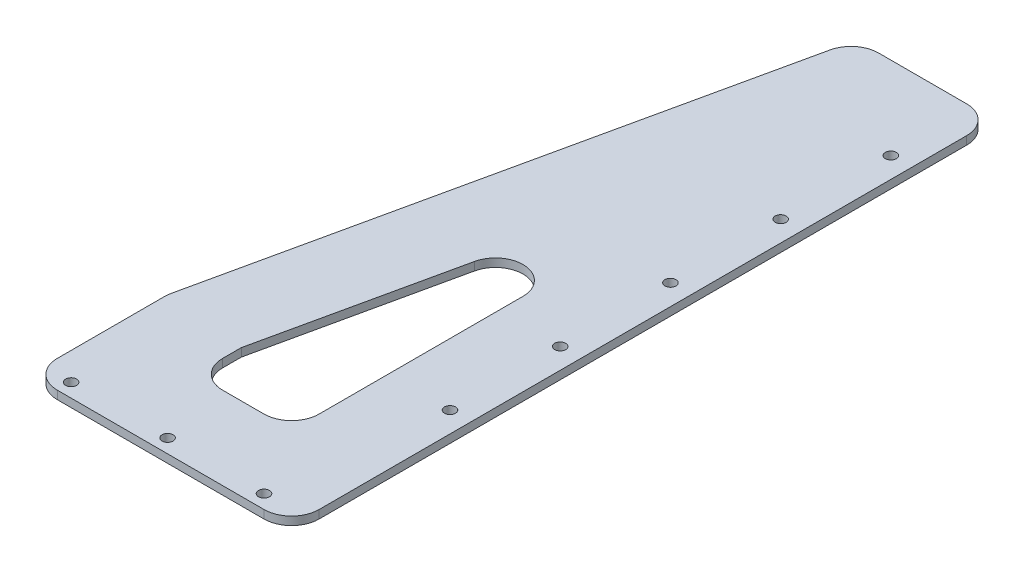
ISO-10303-21;
HEADER;
FILE_DESCRIPTION(('STEP AP214'),'2;1');
FILE_NAME('part.step','',(''),(''),'','','');
FILE_SCHEMA(('AUTOMOTIVE_DESIGN { 1 0 10303 214 1 1 1 1 }'));
ENDSEC;
DATA;
#1=APPLICATION_CONTEXT('core data for automotive mechanical design processes');
#2=APPLICATION_PROTOCOL_DEFINITION('international standard','automotive_design',2000,#1);
#3=PRODUCT_CONTEXT('',#1,'mechanical');
#4=PRODUCT('Part','Part','',(#3));
#5=PRODUCT_RELATED_PRODUCT_CATEGORY('part','',(#4));
#6=PRODUCT_DEFINITION_FORMATION('','',#4);
#7=PRODUCT_DEFINITION_CONTEXT('part definition',#1,'design');
#8=PRODUCT_DEFINITION('design','',#6,#7);
#9=PRODUCT_DEFINITION_SHAPE('','',#8);
#10=(LENGTH_UNIT() NAMED_UNIT(*) SI_UNIT(.MILLI.,.METRE.));
#11=(NAMED_UNIT(*) PLANE_ANGLE_UNIT() SI_UNIT($,.RADIAN.));
#12=(NAMED_UNIT(*) SI_UNIT($,.STERADIAN.) SOLID_ANGLE_UNIT());
#13=UNCERTAINTY_MEASURE_WITH_UNIT(LENGTH_MEASURE(1.E-05),#10,'distance_accuracy_value','');
#14=(GEOMETRIC_REPRESENTATION_CONTEXT(3) GLOBAL_UNCERTAINTY_ASSIGNED_CONTEXT((#13)) GLOBAL_UNIT_ASSIGNED_CONTEXT((#10,
#11,#12)) REPRESENTATION_CONTEXT('',''));
#15=CARTESIAN_POINT('',(0.,0.,0.));
#16=DIRECTION('',(0.,0.,1.));
#17=DIRECTION('',(1.,0.,0.));
#18=AXIS2_PLACEMENT_3D('',#15,#16,#17);
#19=CARTESIAN_POINT('',(0.,3.,0.));
#20=DIRECTION('',(0.,-1.,0.));
#21=DIRECTION('',(0.,0.,-1.));
#22=AXIS2_PLACEMENT_3D('',#19,#20,#21);
#23=PLANE('',#22);
#24=CARTESIAN_POINT('',(87.5000000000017,3.,-65.));
#25=DIRECTION('',(0.,1.,0.));
#26=DIRECTION('',(0.,0.,1.));
#27=AXIS2_PLACEMENT_3D('',#24,#25,#26);
#28=CIRCLE('',#27,2.);
#29=CARTESIAN_POINT('',(87.5000000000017,3.,-63.));
#30=VERTEX_POINT('',#29);
#31=EDGE_CURVE('E458',#30,#30,#28,.T.);
#32=ORIENTED_EDGE('',*,*,#31,.F.);
#33=EDGE_LOOP('',(#32));
#34=FACE_BOUND('',#33,.T.);
#35=CARTESIAN_POINT('',(87.5000000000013,3.,-105.));
#36=DIRECTION('',(0.,1.,0.));
#37=DIRECTION('',(0.,0.,1.));
#38=AXIS2_PLACEMENT_3D('',#35,#36,#37);
#39=CIRCLE('',#38,2.);
#40=CARTESIAN_POINT('',(87.5000000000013,3.,-103.));
#41=VERTEX_POINT('',#40);
#42=EDGE_CURVE('E453',#41,#41,#39,.T.);
#43=ORIENTED_EDGE('',*,*,#42,.F.);
#44=EDGE_LOOP('',(#43));
#45=FACE_BOUND('',#44,.T.);
#46=CARTESIAN_POINT('',(87.5000000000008,3.,-145.));
#47=DIRECTION('',(0.,1.,0.));
#48=DIRECTION('',(0.,0.,1.));
#49=AXIS2_PLACEMENT_3D('',#46,#47,#48);
#50=CIRCLE('',#49,2.);
#51=CARTESIAN_POINT('',(87.5000000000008,3.,-143.));
#52=VERTEX_POINT('',#51);
#53=EDGE_CURVE('E448',#52,#52,#50,.T.);
#54=ORIENTED_EDGE('',*,*,#53,.F.);
#55=EDGE_LOOP('',(#54));
#56=FACE_BOUND('',#55,.T.);
#57=CARTESIAN_POINT('',(87.5000000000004,3.,-185.));
#58=DIRECTION('',(0.,1.,0.));
#59=DIRECTION('',(0.,0.,1.));
#60=AXIS2_PLACEMENT_3D('',#57,#58,#59);
#61=CIRCLE('',#60,2.);
#62=CARTESIAN_POINT('',(87.5000000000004,3.,-183.));
#63=VERTEX_POINT('',#62);
#64=EDGE_CURVE('E443',#63,#63,#61,.T.);
#65=ORIENTED_EDGE('',*,*,#64,.F.);
#66=EDGE_LOOP('',(#65));
#67=FACE_BOUND('',#66,.T.);
#68=CARTESIAN_POINT('',(80.,3.,-5.));
#69=DIRECTION('',(0.,1.,0.));
#70=DIRECTION('',(0.,0.,1.));
#71=AXIS2_PLACEMENT_3D('',#68,#69,#70);
#72=CIRCLE('',#71,2.);
#73=CARTESIAN_POINT('',(80.,3.,-3.));
#74=VERTEX_POINT('',#73);
#75=EDGE_CURVE('E438',#74,#74,#72,.T.);
#76=ORIENTED_EDGE('',*,*,#75,.F.);
#77=EDGE_LOOP('',(#76));
#78=FACE_BOUND('',#77,.T.);
#79=CARTESIAN_POINT('',(45.,3.,-5.));
#80=DIRECTION('',(0.,1.,0.));
#81=DIRECTION('',(0.,0.,1.));
#82=AXIS2_PLACEMENT_3D('',#79,#80,#81);
#83=CIRCLE('',#82,2.);
#84=CARTESIAN_POINT('',(45.,3.,-2.99999999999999));
#85=VERTEX_POINT('',#84);
#86=EDGE_CURVE('E433',#85,#85,#83,.T.);
#87=ORIENTED_EDGE('',*,*,#86,.F.);
#88=EDGE_LOOP('',(#87));
#89=FACE_BOUND('',#88,.T.);
#90=CARTESIAN_POINT('',(87.5,3.,-225.));
#91=DIRECTION('',(0.,1.,0.));
#92=DIRECTION('',(0.,0.,1.));
#93=AXIS2_PLACEMENT_3D('',#90,#91,#92);
#94=CIRCLE('',#93,2.);
#95=CARTESIAN_POINT('',(87.5,3.,-223.));
#96=VERTEX_POINT('',#95);
#97=EDGE_CURVE('E428',#96,#96,#94,.T.);
#98=ORIENTED_EDGE('',*,*,#97,.F.);
#99=EDGE_LOOP('',(#98));
#100=FACE_BOUND('',#99,.T.);
#101=CARTESIAN_POINT('',(10.,3.,-5.));
#102=DIRECTION('',(0.,1.,0.));
#103=DIRECTION('',(0.,0.,1.));
#104=AXIS2_PLACEMENT_3D('',#101,#102,#103);
#105=CIRCLE('',#104,2.);
#106=CARTESIAN_POINT('',(10.,3.,-3.));
#107=VERTEX_POINT('',#106);
#108=EDGE_CURVE('E210',#107,#107,#105,.T.);
#109=ORIENTED_EDGE('',*,*,#108,.F.);
#110=EDGE_LOOP('',(#109));
#111=FACE_BOUND('',#110,.T.);
#112=DIRECTION('',(-0.214407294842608,0.,0.976744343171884));
#113=VECTOR('',#112,1.);
#114=CARTESIAN_POINT('',(0.,3.,-50.));
#115=LINE('',#114,#113);
#116=CARTESIAN_POINT('',(43.275528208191,3.,-247.144072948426));
#117=VERTEX_POINT('',#116);
#118=CARTESIAN_POINT('',(0.232556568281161,3.,-51.0594243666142));
#119=VERTEX_POINT('',#118);
#120=EDGE_CURVE('E236',#117,#119,#115,.T.);
#121=ORIENTED_EDGE('',*,*,#120,.T.);
#122=CARTESIAN_POINT('',(10.,3.,-48.9153514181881));
#123=DIRECTION('',(0.,-1.,0.));
#124=DIRECTION('',(0.,0.,-1.));
#125=AXIS2_PLACEMENT_3D('',#122,#123,#124);
#126=CIRCLE('',#125,10.);
#127=CARTESIAN_POINT('',(0.,3.,-48.9153514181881));
#128=VERTEX_POINT('',#127);
#129=EDGE_CURVE('E296',#119,#128,#126,.F.);
#130=ORIENTED_EDGE('',*,*,#129,.T.);
#131=DIRECTION('',(0.,0.,1.));
#132=VECTOR('',#131,1.);
#133=CARTESIAN_POINT('',(0.,3.,0.));
#134=LINE('',#133,#132);
#135=CARTESIAN_POINT('',(0.,3.,-10.));
#136=VERTEX_POINT('',#135);
#137=EDGE_CURVE('E215',#128,#136,#134,.T.);
#138=ORIENTED_EDGE('',*,*,#137,.T.);
#139=CARTESIAN_POINT('',(10.,3.,-10.));
#140=DIRECTION('',(0.,-1.,0.));
#141=DIRECTION('',(0.,0.,-1.));
#142=AXIS2_PLACEMENT_3D('',#139,#140,#141);
#143=CIRCLE('',#142,10.);
#144=CARTESIAN_POINT('',(10.,3.,0.));
#145=VERTEX_POINT('',#144);
#146=EDGE_CURVE('E293',#136,#145,#143,.F.);
#147=ORIENTED_EDGE('',*,*,#146,.T.);
#148=DIRECTION('',(1.,0.,0.));
#149=VECTOR('',#148,1.);
#150=CARTESIAN_POINT('',(0.,3.,0.));
#151=LINE('',#150,#149);
#152=CARTESIAN_POINT('',(85.,3.,0.));
#153=VERTEX_POINT('',#152);
#154=EDGE_CURVE('E220',#145,#153,#151,.T.);
#155=ORIENTED_EDGE('',*,*,#154,.T.);
#156=CARTESIAN_POINT('',(85.,3.,-10.));
#157=DIRECTION('',(0.,-1.,0.));
#158=DIRECTION('',(0.,0.,-1.));
#159=AXIS2_PLACEMENT_3D('',#156,#157,#158);
#160=CIRCLE('',#159,10.);
#161=CARTESIAN_POINT('',(95.,3.,-10.));
#162=VERTEX_POINT('',#161);
#163=EDGE_CURVE('E290',#153,#162,#160,.F.);
#164=ORIENTED_EDGE('',*,*,#163,.T.);
#165=DIRECTION('',(0.,0.,-1.));
#166=VECTOR('',#165,1.);
#167=CARTESIAN_POINT('',(95.,3.,-255.));
#168=LINE('',#167,#166);
#169=CARTESIAN_POINT('',(95.,3.,-245.));
#170=VERTEX_POINT('',#169);
#171=EDGE_CURVE('E229',#162,#170,#168,.T.);
#172=ORIENTED_EDGE('',*,*,#171,.T.);
#173=CARTESIAN_POINT('',(85.,3.,-245.));
#174=DIRECTION('',(0.,-1.,0.));
#175=DIRECTION('',(0.,0.,-1.));
#176=AXIS2_PLACEMENT_3D('',#173,#174,#175);
#177=CIRCLE('',#176,10.);
#178=CARTESIAN_POINT('',(85.,3.,-255.));
#179=VERTEX_POINT('',#178);
#180=EDGE_CURVE('E287',#170,#179,#177,.F.);
#181=ORIENTED_EDGE('',*,*,#180,.T.);
#182=DIRECTION('',(-1.,0.,0.));
#183=VECTOR('',#182,1.);
#184=CARTESIAN_POINT('',(45.,3.,-255.));
#185=LINE('',#184,#183);
#186=CARTESIAN_POINT('',(53.0429716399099,3.,-255.));
#187=VERTEX_POINT('',#186);
#188=EDGE_CURVE('E233',#179,#187,#185,.T.);
#189=ORIENTED_EDGE('',*,*,#188,.T.);
#190=CARTESIAN_POINT('',(53.0429716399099,3.,-245.));
#191=DIRECTION('',(0.,-1.,0.));
#192=DIRECTION('',(0.,0.,-1.));
#193=AXIS2_PLACEMENT_3D('',#190,#191,#192);
#194=CIRCLE('',#193,10.);
#195=EDGE_CURVE('E285',#187,#117,#194,.F.);
#196=ORIENTED_EDGE('',*,*,#195,.T.);
#197=EDGE_LOOP('',(#121,#130,#138,#147,#155,#164,#172,#181,#189,#196));
#198=FACE_BOUND('',#197,.T.);
#199=DIRECTION('',(0.,0.,1.));
#200=VECTOR('',#199,1.);
#201=CARTESIAN_POINT('',(30.,3.,-30.));
#202=LINE('',#201,#200);
#203=CARTESIAN_POINT('',(30.,3.,-46.7460542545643));
#204=VERTEX_POINT('',#203);
#205=CARTESIAN_POINT('',(30.,3.,-40.));
#206=VERTEX_POINT('',#205);
#207=EDGE_CURVE('E173',#204,#206,#202,.T.);
#208=ORIENTED_EDGE('',*,*,#207,.F.);
#209=DIRECTION('',(-0.214407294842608,0.,0.976744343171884));
#210=VECTOR('',#209,1.);
#211=CARTESIAN_POINT('',(30.,3.,-46.7460542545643));
#212=LINE('',#211,#210);
#213=CARTESIAN_POINT('',(45.2325565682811,3.,-116.138811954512));
#214=VERTEX_POINT('',#213);
#215=EDGE_CURVE('E158',#214,#204,#212,.T.);
#216=ORIENTED_EDGE('',*,*,#215,.F.);
#217=CARTESIAN_POINT('',(55.,3.,-113.994739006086));
#218=DIRECTION('',(0.,-1.,0.));
#219=DIRECTION('',(0.,0.,-1.));
#220=AXIS2_PLACEMENT_3D('',#217,#218,#219);
#221=CIRCLE('',#220,10.);
#222=CARTESIAN_POINT('',(65.,3.,-113.994739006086));
#223=VERTEX_POINT('',#222);
#224=EDGE_CURVE('E12',#214,#223,#221,.T.);
#225=ORIENTED_EDGE('',*,*,#224,.T.);
#226=DIRECTION('',(0.,0.,-1.));
#227=VECTOR('',#226,1.);
#228=CARTESIAN_POINT('',(65.,3.,-30.));
#229=LINE('',#228,#227);
#230=CARTESIAN_POINT('',(65.,3.,-40.));
#231=VERTEX_POINT('',#230);
#232=EDGE_CURVE('E166',#231,#223,#229,.T.);
#233=ORIENTED_EDGE('',*,*,#232,.F.);
#234=CARTESIAN_POINT('',(55.,3.,-40.));
#235=DIRECTION('',(0.,-1.,0.));
#236=DIRECTION('',(0.,0.,-1.));
#237=AXIS2_PLACEMENT_3D('',#234,#235,#236);
#238=CIRCLE('',#237,10.);
#239=CARTESIAN_POINT('',(55.,3.,-30.));
#240=VERTEX_POINT('',#239);
#241=EDGE_CURVE('E316',#231,#240,#238,.T.);
#242=ORIENTED_EDGE('',*,*,#241,.T.);
#243=DIRECTION('',(1.,0.,0.));
#244=VECTOR('',#243,1.);
#245=CARTESIAN_POINT('',(30.,3.,-30.));
#246=LINE('',#245,#244);
#247=CARTESIAN_POINT('',(40.,3.,-30.));
#248=VERTEX_POINT('',#247);
#249=EDGE_CURVE('E183',#248,#240,#246,.T.);
#250=ORIENTED_EDGE('',*,*,#249,.F.);
#251=CARTESIAN_POINT('',(40.,3.,-40.));
#252=DIRECTION('',(0.,-1.,0.));
#253=DIRECTION('',(0.,0.,-1.));
#254=AXIS2_PLACEMENT_3D('',#251,#252,#253);
#255=CIRCLE('',#254,10.);
#256=EDGE_CURVE('E181',#248,#206,#255,.T.);
#257=ORIENTED_EDGE('',*,*,#256,.T.);
#258=EDGE_LOOP('',(#208,#216,#225,#233,#242,#250,#257));
#259=FACE_BOUND('',#258,.T.);
#260=ADVANCED_FACE('F37',(#34,#45,#56,#67,#78,#89,#100,#111,#198,#259),#23,.F.);
#261=CARTESIAN_POINT('',(0.,0.,0.));
#262=DIRECTION('',(0.,-1.,0.));
#263=DIRECTION('',(0.,0.,-1.));
#264=AXIS2_PLACEMENT_3D('',#261,#262,#263);
#265=PLANE('',#264);
#266=CARTESIAN_POINT('',(87.5000000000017,0.,-65.));
#267=DIRECTION('',(0.,-1.,0.));
#268=DIRECTION('',(0.,0.,-1.));
#269=AXIS2_PLACEMENT_3D('',#266,#267,#268);
#270=CIRCLE('',#269,2.);
#271=CARTESIAN_POINT('',(87.5000000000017,0.,-63.));
#272=VERTEX_POINT('',#271);
#273=EDGE_CURVE('E460',#272,#272,#270,.F.);
#274=ORIENTED_EDGE('',*,*,#273,.T.);
#275=EDGE_LOOP('',(#274));
#276=FACE_BOUND('',#275,.T.);
#277=CARTESIAN_POINT('',(87.5000000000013,0.,-105.));
#278=DIRECTION('',(0.,-1.,0.));
#279=DIRECTION('',(0.,0.,-1.));
#280=AXIS2_PLACEMENT_3D('',#277,#278,#279);
#281=CIRCLE('',#280,2.);
#282=CARTESIAN_POINT('',(87.5000000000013,0.,-103.));
#283=VERTEX_POINT('',#282);
#284=EDGE_CURVE('E456',#283,#283,#281,.F.);
#285=ORIENTED_EDGE('',*,*,#284,.T.);
#286=EDGE_LOOP('',(#285));
#287=FACE_BOUND('',#286,.T.);
#288=CARTESIAN_POINT('',(87.5000000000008,0.,-145.));
#289=DIRECTION('',(0.,-1.,0.));
#290=DIRECTION('',(0.,0.,-1.));
#291=AXIS2_PLACEMENT_3D('',#288,#289,#290);
#292=CIRCLE('',#291,2.);
#293=CARTESIAN_POINT('',(87.5000000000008,0.,-143.));
#294=VERTEX_POINT('',#293);
#295=EDGE_CURVE('E451',#294,#294,#292,.F.);
#296=ORIENTED_EDGE('',*,*,#295,.T.);
#297=EDGE_LOOP('',(#296));
#298=FACE_BOUND('',#297,.T.);
#299=CARTESIAN_POINT('',(87.5000000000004,0.,-185.));
#300=DIRECTION('',(0.,-1.,0.));
#301=DIRECTION('',(0.,0.,-1.));
#302=AXIS2_PLACEMENT_3D('',#299,#300,#301);
#303=CIRCLE('',#302,2.);
#304=CARTESIAN_POINT('',(87.5000000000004,0.,-183.));
#305=VERTEX_POINT('',#304);
#306=EDGE_CURVE('E446',#305,#305,#303,.F.);
#307=ORIENTED_EDGE('',*,*,#306,.T.);
#308=EDGE_LOOP('',(#307));
#309=FACE_BOUND('',#308,.T.);
#310=CARTESIAN_POINT('',(80.,0.,-5.));
#311=DIRECTION('',(0.,-1.,0.));
#312=DIRECTION('',(0.,0.,-1.));
#313=AXIS2_PLACEMENT_3D('',#310,#311,#312);
#314=CIRCLE('',#313,2.);
#315=CARTESIAN_POINT('',(80.,0.,-3.));
#316=VERTEX_POINT('',#315);
#317=EDGE_CURVE('E441',#316,#316,#314,.F.);
#318=ORIENTED_EDGE('',*,*,#317,.T.);
#319=EDGE_LOOP('',(#318));
#320=FACE_BOUND('',#319,.T.);
#321=CARTESIAN_POINT('',(45.,0.,-5.));
#322=DIRECTION('',(0.,-1.,0.));
#323=DIRECTION('',(0.,0.,-1.));
#324=AXIS2_PLACEMENT_3D('',#321,#322,#323);
#325=CIRCLE('',#324,2.);
#326=CARTESIAN_POINT('',(45.,0.,-2.99999999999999));
#327=VERTEX_POINT('',#326);
#328=EDGE_CURVE('E436',#327,#327,#325,.F.);
#329=ORIENTED_EDGE('',*,*,#328,.T.);
#330=EDGE_LOOP('',(#329));
#331=FACE_BOUND('',#330,.T.);
#332=CARTESIAN_POINT('',(87.5,0.,-225.));
#333=DIRECTION('',(0.,-1.,0.));
#334=DIRECTION('',(0.,0.,-1.));
#335=AXIS2_PLACEMENT_3D('',#332,#333,#334);
#336=CIRCLE('',#335,2.);
#337=CARTESIAN_POINT('',(87.5,0.,-223.));
#338=VERTEX_POINT('',#337);
#339=EDGE_CURVE('E431',#338,#338,#336,.F.);
#340=ORIENTED_EDGE('',*,*,#339,.T.);
#341=EDGE_LOOP('',(#340));
#342=FACE_BOUND('',#341,.T.);
#343=CARTESIAN_POINT('',(10.,0.,-5.));
#344=DIRECTION('',(0.,-1.,0.));
#345=DIRECTION('',(0.,0.,-1.));
#346=AXIS2_PLACEMENT_3D('',#343,#344,#345);
#347=CIRCLE('',#346,2.);
#348=CARTESIAN_POINT('',(10.,0.,-3.));
#349=VERTEX_POINT('',#348);
#350=EDGE_CURVE('E194',#349,#349,#347,.F.);
#351=ORIENTED_EDGE('',*,*,#350,.T.);
#352=EDGE_LOOP('',(#351));
#353=FACE_BOUND('',#352,.T.);
#354=DIRECTION('',(0.,0.,1.));
#355=VECTOR('',#354,1.);
#356=CARTESIAN_POINT('',(0.,0.,0.));
#357=LINE('',#356,#355);
#358=CARTESIAN_POINT('',(0.,0.,-48.9153514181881));
#359=VERTEX_POINT('',#358);
#360=CARTESIAN_POINT('',(0.,0.,-10.));
#361=VERTEX_POINT('',#360);
#362=EDGE_CURVE('E177',#359,#361,#357,.T.);
#363=ORIENTED_EDGE('',*,*,#362,.F.);
#364=CARTESIAN_POINT('',(10.,0.,-48.9153514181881));
#365=DIRECTION('',(0.,-1.,0.));
#366=DIRECTION('',(0.,0.,-1.));
#367=AXIS2_PLACEMENT_3D('',#364,#365,#366);
#368=CIRCLE('',#367,10.);
#369=CARTESIAN_POINT('',(0.232556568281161,0.,-51.0594243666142));
#370=VERTEX_POINT('',#369);
#371=EDGE_CURVE('E278',#359,#370,#368,.T.);
#372=ORIENTED_EDGE('',*,*,#371,.T.);
#373=DIRECTION('',(-0.214407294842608,0.,0.976744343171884));
#374=VECTOR('',#373,1.);
#375=CARTESIAN_POINT('',(0.,0.,-50.));
#376=LINE('',#375,#374);
#377=CARTESIAN_POINT('',(43.275528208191,0.,-247.144072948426));
#378=VERTEX_POINT('',#377);
#379=EDGE_CURVE('E221',#378,#370,#376,.T.);
#380=ORIENTED_EDGE('',*,*,#379,.F.);
#381=CARTESIAN_POINT('',(53.0429716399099,0.,-245.));
#382=DIRECTION('',(0.,-1.,0.));
#383=DIRECTION('',(0.,0.,-1.));
#384=AXIS2_PLACEMENT_3D('',#381,#382,#383);
#385=CIRCLE('',#384,10.);
#386=CARTESIAN_POINT('',(53.0429716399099,0.,-255.));
#387=VERTEX_POINT('',#386);
#388=EDGE_CURVE('E270',#378,#387,#385,.T.);
#389=ORIENTED_EDGE('',*,*,#388,.T.);
#390=DIRECTION('',(-1.,0.,0.));
#391=VECTOR('',#390,1.);
#392=CARTESIAN_POINT('',(45.,0.,-255.));
#393=LINE('',#392,#391);
#394=CARTESIAN_POINT('',(85.,0.,-255.));
#395=VERTEX_POINT('',#394);
#396=EDGE_CURVE('E250',#395,#387,#393,.T.);
#397=ORIENTED_EDGE('',*,*,#396,.F.);
#398=CARTESIAN_POINT('',(85.,0.,-245.));
#399=DIRECTION('',(0.,-1.,0.));
#400=DIRECTION('',(0.,0.,-1.));
#401=AXIS2_PLACEMENT_3D('',#398,#399,#400);
#402=CIRCLE('',#401,10.);
#403=CARTESIAN_POINT('',(95.,0.,-245.));
#404=VERTEX_POINT('',#403);
#405=EDGE_CURVE('E272',#395,#404,#402,.T.);
#406=ORIENTED_EDGE('',*,*,#405,.T.);
#407=DIRECTION('',(0.,0.,-1.));
#408=VECTOR('',#407,1.);
#409=CARTESIAN_POINT('',(95.,0.,-255.));
#410=LINE('',#409,#408);
#411=CARTESIAN_POINT('',(95.,0.,-10.));
#412=VERTEX_POINT('',#411);
#413=EDGE_CURVE('E247',#412,#404,#410,.T.);
#414=ORIENTED_EDGE('',*,*,#413,.F.);
#415=CARTESIAN_POINT('',(85.,0.,-10.));
#416=DIRECTION('',(0.,-1.,0.));
#417=DIRECTION('',(0.,0.,-1.));
#418=AXIS2_PLACEMENT_3D('',#415,#416,#417);
#419=CIRCLE('',#418,10.);
#420=CARTESIAN_POINT('',(85.,0.,0.));
#421=VERTEX_POINT('',#420);
#422=EDGE_CURVE('E274',#412,#421,#419,.T.);
#423=ORIENTED_EDGE('',*,*,#422,.T.);
#424=DIRECTION('',(1.,0.,0.));
#425=VECTOR('',#424,1.);
#426=CARTESIAN_POINT('',(0.,0.,0.));
#427=LINE('',#426,#425);
#428=CARTESIAN_POINT('',(10.,0.,0.));
#429=VERTEX_POINT('',#428);
#430=EDGE_CURVE('E244',#429,#421,#427,.T.);
#431=ORIENTED_EDGE('',*,*,#430,.F.);
#432=CARTESIAN_POINT('',(10.,0.,-10.));
#433=DIRECTION('',(0.,-1.,0.));
#434=DIRECTION('',(0.,0.,-1.));
#435=AXIS2_PLACEMENT_3D('',#432,#433,#434);
#436=CIRCLE('',#435,10.);
#437=EDGE_CURVE('E276',#429,#361,#436,.T.);
#438=ORIENTED_EDGE('',*,*,#437,.T.);
#439=EDGE_LOOP('',(#363,#372,#380,#389,#397,#406,#414,#423,#431,#438));
#440=FACE_BOUND('',#439,.T.);
#441=DIRECTION('',(0.,0.,-1.));
#442=VECTOR('',#441,1.);
#443=CARTESIAN_POINT('',(65.,0.,-91.4920660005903));
#444=LINE('',#443,#442);
#445=CARTESIAN_POINT('',(65.,0.,-40.));
#446=VERTEX_POINT('',#445);
#447=CARTESIAN_POINT('',(65.,0.,-113.994739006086));
#448=VERTEX_POINT('',#447);
#449=EDGE_CURVE('E190',#446,#448,#444,.T.);
#450=ORIENTED_EDGE('',*,*,#449,.T.);
#451=CARTESIAN_POINT('',(55.,0.,-113.994739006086));
#452=DIRECTION('',(0.,-1.,0.));
#453=DIRECTION('',(0.,0.,-1.));
#454=AXIS2_PLACEMENT_3D('',#451,#452,#453);
#455=CIRCLE('',#454,10.);
#456=CARTESIAN_POINT('',(45.2325565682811,0.,-116.138811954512));
#457=VERTEX_POINT('',#456);
#458=EDGE_CURVE('E47',#448,#457,#455,.F.);
#459=ORIENTED_EDGE('',*,*,#458,.T.);
#460=DIRECTION('',(-0.214407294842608,0.,0.976744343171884));
#461=VECTOR('',#460,1.);
#462=CARTESIAN_POINT('',(30.,0.,-46.7460542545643));
#463=LINE('',#462,#461);
#464=CARTESIAN_POINT('',(30.,0.,-46.7460542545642));
#465=VERTEX_POINT('',#464);
#466=EDGE_CURVE('E184',#457,#465,#463,.T.);
#467=ORIENTED_EDGE('',*,*,#466,.T.);
#468=DIRECTION('',(0.,0.,1.));
#469=VECTOR('',#468,1.);
#470=CARTESIAN_POINT('',(30.,0.,-30.));
#471=LINE('',#470,#469);
#472=CARTESIAN_POINT('',(30.,0.,-40.));
#473=VERTEX_POINT('',#472);
#474=EDGE_CURVE('E176',#465,#473,#471,.T.);
#475=ORIENTED_EDGE('',*,*,#474,.T.);
#476=CARTESIAN_POINT('',(40.,0.,-40.));
#477=DIRECTION('',(0.,-1.,0.));
#478=DIRECTION('',(0.,0.,-1.));
#479=AXIS2_PLACEMENT_3D('',#476,#477,#478);
#480=CIRCLE('',#479,10.);
#481=CARTESIAN_POINT('',(40.,0.,-30.));
#482=VERTEX_POINT('',#481);
#483=EDGE_CURVE('E320',#473,#482,#480,.F.);
#484=ORIENTED_EDGE('',*,*,#483,.T.);
#485=DIRECTION('',(1.,0.,0.));
#486=VECTOR('',#485,1.);
#487=CARTESIAN_POINT('',(30.,0.,-30.));
#488=LINE('',#487,#486);
#489=CARTESIAN_POINT('',(55.,0.,-30.));
#490=VERTEX_POINT('',#489);
#491=EDGE_CURVE('E209',#482,#490,#488,.T.);
#492=ORIENTED_EDGE('',*,*,#491,.T.);
#493=CARTESIAN_POINT('',(55.,0.,-40.));
#494=DIRECTION('',(0.,-1.,0.));
#495=DIRECTION('',(0.,0.,-1.));
#496=AXIS2_PLACEMENT_3D('',#493,#494,#495);
#497=CIRCLE('',#496,10.);
#498=EDGE_CURVE('E314',#490,#446,#497,.F.);
#499=ORIENTED_EDGE('',*,*,#498,.T.);
#500=EDGE_LOOP('',(#450,#459,#467,#475,#484,#492,#499));
#501=FACE_BOUND('',#500,.T.);
#502=ADVANCED_FACE('F325',(#276,#287,#298,#309,#320,#331,#342,#353,#440,#501),#265,.T.);
#503=CARTESIAN_POINT('',(0.,3.,0.));
#504=DIRECTION('',(1.,0.,0.));
#505=DIRECTION('',(0.,0.,-1.));
#506=AXIS2_PLACEMENT_3D('',#503,#504,#505);
#507=PLANE('',#506);
#508=ORIENTED_EDGE('',*,*,#137,.F.);
#509=DIRECTION('',(0.,-1.,0.));
#510=VECTOR('',#509,1.);
#511=CARTESIAN_POINT('',(0.,3.,-48.9153514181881));
#512=LINE('',#511,#510);
#513=EDGE_CURVE('E267',#128,#359,#512,.T.);
#514=ORIENTED_EDGE('',*,*,#513,.T.);
#515=ORIENTED_EDGE('',*,*,#362,.T.);
#516=DIRECTION('',(0.,-1.,0.));
#517=VECTOR('',#516,1.);
#518=CARTESIAN_POINT('',(0.,3.,-10.));
#519=LINE('',#518,#517);
#520=EDGE_CURVE('E265',#361,#136,#519,.F.);
#521=ORIENTED_EDGE('',*,*,#520,.T.);
#522=EDGE_LOOP('',(#508,#514,#515,#521));
#523=FACE_BOUND('',#522,.T.);
#524=ADVANCED_FACE('F364',(#523),#507,.F.);
#525=CARTESIAN_POINT('',(0.,3.,0.));
#526=DIRECTION('',(0.,0.,-1.));
#527=DIRECTION('',(-1.,0.,0.));
#528=AXIS2_PLACEMENT_3D('',#525,#526,#527);
#529=PLANE('',#528);
#530=ORIENTED_EDGE('',*,*,#154,.F.);
#531=DIRECTION('',(0.,-1.,0.));
#532=VECTOR('',#531,1.);
#533=CARTESIAN_POINT('',(10.,3.,0.));
#534=LINE('',#533,#532);
#535=EDGE_CURVE('E301',#145,#429,#534,.T.);
#536=ORIENTED_EDGE('',*,*,#535,.T.);
#537=ORIENTED_EDGE('',*,*,#430,.T.);
#538=DIRECTION('',(0.,-1.,0.));
#539=VECTOR('',#538,1.);
#540=CARTESIAN_POINT('',(85.,3.,0.));
#541=LINE('',#540,#539);
#542=EDGE_CURVE('E299',#421,#153,#541,.F.);
#543=ORIENTED_EDGE('',*,*,#542,.T.);
#544=EDGE_LOOP('',(#530,#536,#537,#543));
#545=FACE_BOUND('',#544,.T.);
#546=ADVANCED_FACE('F382',(#545),#529,.F.);
#547=CARTESIAN_POINT('',(95.,3.,-255.));
#548=DIRECTION('',(-1.,0.,0.));
#549=DIRECTION('',(0.,0.,1.));
#550=AXIS2_PLACEMENT_3D('',#547,#548,#549);
#551=PLANE('',#550);
#552=ORIENTED_EDGE('',*,*,#171,.F.);
#553=DIRECTION('',(0.,-1.,0.));
#554=VECTOR('',#553,1.);
#555=CARTESIAN_POINT('',(95.,3.,-10.));
#556=LINE('',#555,#554);
#557=EDGE_CURVE('E306',#162,#412,#556,.T.);
#558=ORIENTED_EDGE('',*,*,#557,.T.);
#559=ORIENTED_EDGE('',*,*,#413,.T.);
#560=DIRECTION('',(0.,-1.,0.));
#561=VECTOR('',#560,1.);
#562=CARTESIAN_POINT('',(95.,3.,-245.));
#563=LINE('',#562,#561);
#564=EDGE_CURVE('E304',#404,#170,#563,.F.);
#565=ORIENTED_EDGE('',*,*,#564,.T.);
#566=EDGE_LOOP('',(#552,#558,#559,#565));
#567=FACE_BOUND('',#566,.T.);
#568=ADVANCED_FACE('F379',(#567),#551,.F.);
#569=CARTESIAN_POINT('',(45.,3.,-255.));
#570=DIRECTION('',(0.,0.,1.));
#571=DIRECTION('',(1.,0.,0.));
#572=AXIS2_PLACEMENT_3D('',#569,#570,#571);
#573=PLANE('',#572);
#574=ORIENTED_EDGE('',*,*,#188,.F.);
#575=DIRECTION('',(0.,-1.,0.));
#576=VECTOR('',#575,1.);
#577=CARTESIAN_POINT('',(85.,3.,-255.));
#578=LINE('',#577,#576);
#579=EDGE_CURVE('E310',#179,#395,#578,.T.);
#580=ORIENTED_EDGE('',*,*,#579,.T.);
#581=ORIENTED_EDGE('',*,*,#396,.T.);
#582=DIRECTION('',(0.,-1.,0.));
#583=VECTOR('',#582,1.);
#584=CARTESIAN_POINT('',(53.0429716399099,3.,-255.));
#585=LINE('',#584,#583);
#586=EDGE_CURVE('E62',#387,#187,#585,.F.);
#587=ORIENTED_EDGE('',*,*,#586,.T.);
#588=EDGE_LOOP('',(#574,#580,#581,#587));
#589=FACE_BOUND('',#588,.T.);
#590=ADVANCED_FACE('F375',(#589),#573,.F.);
#591=CARTESIAN_POINT('',(0.,3.,-50.));
#592=DIRECTION('',(0.976744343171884,0.,0.214407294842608));
#593=DIRECTION('',(0.214407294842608,0.,-0.976744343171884));
#594=AXIS2_PLACEMENT_3D('',#591,#592,#593);
#595=PLANE('',#594);
#596=ORIENTED_EDGE('',*,*,#379,.T.);
#597=DIRECTION('',(0.,-1.,0.));
#598=VECTOR('',#597,1.);
#599=CARTESIAN_POINT('',(0.232556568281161,3.,-51.0594243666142));
#600=LINE('',#599,#598);
#601=EDGE_CURVE('E283',#370,#119,#600,.F.);
#602=ORIENTED_EDGE('',*,*,#601,.T.);
#603=ORIENTED_EDGE('',*,*,#120,.F.);
#604=DIRECTION('',(0.,-1.,0.));
#605=VECTOR('',#604,1.);
#606=CARTESIAN_POINT('',(43.275528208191,3.,-247.144072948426));
#607=LINE('',#606,#605);
#608=EDGE_CURVE('E280',#117,#378,#607,.T.);
#609=ORIENTED_EDGE('',*,*,#608,.T.);
#610=EDGE_LOOP('',(#596,#602,#603,#609));
#611=FACE_BOUND('',#610,.T.);
#612=ADVANCED_FACE('F372',(#611),#595,.F.);
#613=CARTESIAN_POINT('',(30.,3.,-30.));
#614=DIRECTION('',(1.,0.,0.));
#615=DIRECTION('',(0.,0.,-1.));
#616=AXIS2_PLACEMENT_3D('',#613,#614,#615);
#617=PLANE('',#616);
#618=ORIENTED_EDGE('',*,*,#207,.T.);
#619=DIRECTION('',(0.,-1.,0.));
#620=VECTOR('',#619,1.);
#621=CARTESIAN_POINT('',(30.,0.,-40.));
#622=LINE('',#621,#620);
#623=EDGE_CURVE('E263',#206,#473,#622,.T.);
#624=ORIENTED_EDGE('',*,*,#623,.T.);
#625=ORIENTED_EDGE('',*,*,#474,.F.);
#626=DIRECTION('',(0.,-1.,0.));
#627=VECTOR('',#626,1.);
#628=CARTESIAN_POINT('',(30.,3.,-46.7460542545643));
#629=LINE('',#628,#627);
#630=EDGE_CURVE('E161',#204,#465,#629,.T.);
#631=ORIENTED_EDGE('',*,*,#630,.F.);
#632=EDGE_LOOP('',(#618,#624,#625,#631));
#633=FACE_BOUND('',#632,.T.);
#634=ADVANCED_FACE('F171',(#633),#617,.T.);
#635=CARTESIAN_POINT('',(30.,3.,-30.));
#636=DIRECTION('',(0.,0.,-1.));
#637=DIRECTION('',(-1.,0.,0.));
#638=AXIS2_PLACEMENT_3D('',#635,#636,#637);
#639=PLANE('',#638);
#640=ORIENTED_EDGE('',*,*,#249,.T.);
#641=DIRECTION('',(0.,-1.,0.));
#642=VECTOR('',#641,1.);
#643=CARTESIAN_POINT('',(55.,0.,-30.));
#644=LINE('',#643,#642);
#645=EDGE_CURVE('E255',#240,#490,#644,.T.);
#646=ORIENTED_EDGE('',*,*,#645,.T.);
#647=ORIENTED_EDGE('',*,*,#491,.F.);
#648=DIRECTION('',(0.,-1.,0.));
#649=VECTOR('',#648,1.);
#650=CARTESIAN_POINT('',(40.,3.,-30.));
#651=LINE('',#650,#649);
#652=EDGE_CURVE('E241',#482,#248,#651,.F.);
#653=ORIENTED_EDGE('',*,*,#652,.T.);
#654=EDGE_LOOP('',(#640,#646,#647,#653));
#655=FACE_BOUND('',#654,.T.);
#656=ADVANCED_FACE('F340',(#655),#639,.T.);
#657=CARTESIAN_POINT('',(65.,3.,-91.4920660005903));
#658=DIRECTION('',(-1.,0.,0.));
#659=DIRECTION('',(0.,0.,1.));
#660=AXIS2_PLACEMENT_3D('',#657,#658,#659);
#661=PLANE('',#660);
#662=ORIENTED_EDGE('',*,*,#449,.F.);
#663=DIRECTION('',(0.,-1.,0.));
#664=VECTOR('',#663,1.);
#665=CARTESIAN_POINT('',(65.,3.,-40.));
#666=LINE('',#665,#664);
#667=EDGE_CURVE('E261',#446,#231,#666,.F.);
#668=ORIENTED_EDGE('',*,*,#667,.T.);
#669=ORIENTED_EDGE('',*,*,#232,.T.);
#670=DIRECTION('',(0.,-1.,0.));
#671=VECTOR('',#670,1.);
#672=CARTESIAN_POINT('',(65.,0.,-113.994739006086));
#673=LINE('',#672,#671);
#674=EDGE_CURVE('E258',#223,#448,#673,.T.);
#675=ORIENTED_EDGE('',*,*,#674,.T.);
#676=EDGE_LOOP('',(#662,#668,#669,#675));
#677=FACE_BOUND('',#676,.T.);
#678=ADVANCED_FACE('F333',(#677),#661,.T.);
#679=CARTESIAN_POINT('',(30.,3.,-46.7460542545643));
#680=DIRECTION('',(0.976744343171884,0.,0.214407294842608));
#681=DIRECTION('',(0.214407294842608,0.,-0.976744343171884));
#682=AXIS2_PLACEMENT_3D('',#679,#680,#681);
#683=PLANE('',#682);
#684=ORIENTED_EDGE('',*,*,#466,.F.);
#685=DIRECTION('',(0.,-1.,0.));
#686=VECTOR('',#685,1.);
#687=CARTESIAN_POINT('',(45.2325565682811,3.,-116.138811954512));
#688=LINE('',#687,#686);
#689=EDGE_CURVE('E54',#457,#214,#688,.F.);
#690=ORIENTED_EDGE('',*,*,#689,.T.);
#691=ORIENTED_EDGE('',*,*,#215,.T.);
#692=ORIENTED_EDGE('',*,*,#630,.T.);
#693=EDGE_LOOP('',(#684,#690,#691,#692));
#694=FACE_BOUND('',#693,.T.);
#695=ADVANCED_FACE('F160',(#694),#683,.T.);
#696=CARTESIAN_POINT('',(10.,-0.00100000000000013,-5.));
#697=DIRECTION('',(0.,1.,0.));
#698=DIRECTION('',(0.,0.,1.));
#699=AXIS2_PLACEMENT_3D('',#696,#697,#698);
#700=CYLINDRICAL_SURFACE('',#699,2.);
#701=CARTESIAN_POINT('',(10.,0.,-3.));
#702=CARTESIAN_POINT('',(10.,0.03125,-3.));
#703=CARTESIAN_POINT('',(10.,0.0625,-3.));
#704=CARTESIAN_POINT('',(10.,0.125,-3.));
#705=CARTESIAN_POINT('',(10.,0.15625,-3.));
#706=CARTESIAN_POINT('',(10.,0.21875,-3.));
#707=CARTESIAN_POINT('',(10.,0.25,-3.));
#708=CARTESIAN_POINT('',(10.,0.3125,-3.));
#709=CARTESIAN_POINT('',(10.,0.34375,-3.));
#710=CARTESIAN_POINT('',(10.,0.40625,-3.));
#711=CARTESIAN_POINT('',(10.,0.4375,-3.));
#712=CARTESIAN_POINT('',(10.,0.5,-3.));
#713=CARTESIAN_POINT('',(10.,0.53125,-3.));
#714=CARTESIAN_POINT('',(10.,0.59375,-3.));
#715=CARTESIAN_POINT('',(10.,0.625,-3.));
#716=CARTESIAN_POINT('',(10.,0.6875,-3.));
#717=CARTESIAN_POINT('',(10.,0.71875,-3.));
#718=CARTESIAN_POINT('',(10.,0.78125,-3.));
#719=CARTESIAN_POINT('',(10.,0.8125,-3.));
#720=CARTESIAN_POINT('',(10.,0.875,-3.));
#721=CARTESIAN_POINT('',(10.,0.90625,-3.));
#722=CARTESIAN_POINT('',(10.,0.96875,-3.));
#723=CARTESIAN_POINT('',(10.,1.,-3.));
#724=CARTESIAN_POINT('',(10.,1.0625,-3.));
#725=CARTESIAN_POINT('',(10.,1.09375,-3.));
#726=CARTESIAN_POINT('',(10.,1.15625,-3.));
#727=CARTESIAN_POINT('',(10.,1.1875,-3.));
#728=CARTESIAN_POINT('',(10.,1.25,-3.));
#729=CARTESIAN_POINT('',(10.,1.28125,-3.));
#730=CARTESIAN_POINT('',(10.,1.34375,-3.));
#731=CARTESIAN_POINT('',(10.,1.375,-3.));
#732=CARTESIAN_POINT('',(10.,1.4375,-3.));
#733=CARTESIAN_POINT('',(10.,1.46875,-3.));
#734=CARTESIAN_POINT('',(10.,1.53125,-3.));
#735=CARTESIAN_POINT('',(10.,1.5625,-3.));
#736=CARTESIAN_POINT('',(10.,1.625,-3.));
#737=CARTESIAN_POINT('',(10.,1.65625,-3.));
#738=CARTESIAN_POINT('',(10.,1.71875,-3.));
#739=CARTESIAN_POINT('',(10.,1.75,-3.));
#740=CARTESIAN_POINT('',(10.,1.8125,-3.));
#741=CARTESIAN_POINT('',(10.,1.84375,-3.));
#742=CARTESIAN_POINT('',(10.,1.90625,-3.));
#743=CARTESIAN_POINT('',(10.,1.9375,-3.));
#744=CARTESIAN_POINT('',(10.,2.,-3.));
#745=CARTESIAN_POINT('',(10.,2.03125,-3.));
#746=CARTESIAN_POINT('',(10.,2.09375,-3.));
#747=CARTESIAN_POINT('',(10.,2.125,-3.));
#748=CARTESIAN_POINT('',(10.,2.1875,-3.));
#749=CARTESIAN_POINT('',(10.,2.21875,-3.));
#750=CARTESIAN_POINT('',(10.,2.28125,-3.));
#751=CARTESIAN_POINT('',(10.,2.3125,-3.));
#752=CARTESIAN_POINT('',(10.,2.375,-3.));
#753=CARTESIAN_POINT('',(10.,2.40625,-3.));
#754=CARTESIAN_POINT('',(10.,2.46875,-3.));
#755=CARTESIAN_POINT('',(10.,2.5,-3.));
#756=CARTESIAN_POINT('',(10.,2.5625,-3.));
#757=CARTESIAN_POINT('',(10.,2.59375,-3.));
#758=CARTESIAN_POINT('',(10.,2.65625,-3.));
#759=CARTESIAN_POINT('',(10.,2.6875,-3.));
#760=CARTESIAN_POINT('',(10.,2.75,-3.));
#761=CARTESIAN_POINT('',(10.,2.78125,-3.));
#762=CARTESIAN_POINT('',(10.,2.84375,-3.));
#763=CARTESIAN_POINT('',(10.,2.875,-3.));
#764=CARTESIAN_POINT('',(10.,2.9375,-3.));
#765=CARTESIAN_POINT('',(10.,2.96875,-3.));
#766=CARTESIAN_POINT('',(10.,3.,-3.));
#767=B_SPLINE_CURVE_WITH_KNOTS('',3,(#701,#702,#703,#704,#705,#706,#707,#708,#709,#710,#711,
#712,#713,#714,#715,#716,#717,#718,#719,#720,#721,#722,#723,#724,#725,#726,#727,#728,#729,#730,
#731,#732,#733,#734,#735,#736,#737,#738,#739,#740,#741,#742,#743,#744,#745,#746,#747,#748,#749,
#750,#751,#752,#753,#754,#755,#756,#757,#758,#759,#760,#761,#762,#763,#764,#765,#766),
.UNSPECIFIED.,.F.,.F.,(4,2,2,2,2,2,2,2,2,2,2,2,2,2,2,2,2,2,2,2,2,2,2,2,2,2,2,2,2,2,2,2,4),(0.,
0.09375,0.1875,0.28125,0.375,0.46875,0.5625,0.65625,0.75,0.84375,0.9375,1.03125,1.125,1.21875,
1.3125,1.40625,1.5,1.59375,1.6875,1.78125,1.875,1.96875,2.0625,2.15625,2.25,2.34375,2.4375,
2.53125,2.625,2.71875,2.8125,2.90625,3.),.UNSPECIFIED.);
#768=EDGE_CURVE('BSEAM499',#349,#107,#767,.T.);
#769=ORIENTED_EDGE('',*,*,#350,.F.);
#770=ORIENTED_EDGE('',*,*,#108,.T.);
#771=ORIENTED_EDGE('',*,*,#768,.T.);
#772=ORIENTED_EDGE('',*,*,#768,.F.);
#773=EDGE_LOOP('',(#769,#771,#770,#772));
#774=FACE_BOUND('',#773,.T.);
#775=ADVANCED_FACE('F499',(#774),#700,.F.);
#776=CARTESIAN_POINT('',(87.5,-0.00100000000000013,-225.));
#777=DIRECTION('',(0.,1.,0.));
#778=DIRECTION('',(0.,0.,1.));
#779=AXIS2_PLACEMENT_3D('',#776,#777,#778);
#780=CYLINDRICAL_SURFACE('',#779,2.);
#781=CARTESIAN_POINT('',(87.5,0.,-223.));
#782=CARTESIAN_POINT('',(87.5,0.03125,-223.));
#783=CARTESIAN_POINT('',(87.5,0.0625,-223.));
#784=CARTESIAN_POINT('',(87.5,0.125,-223.));
#785=CARTESIAN_POINT('',(87.5,0.15625,-223.));
#786=CARTESIAN_POINT('',(87.5,0.21875,-223.));
#787=CARTESIAN_POINT('',(87.5,0.25,-223.));
#788=CARTESIAN_POINT('',(87.5,0.3125,-223.));
#789=CARTESIAN_POINT('',(87.5,0.34375,-223.));
#790=CARTESIAN_POINT('',(87.5,0.40625,-223.));
#791=CARTESIAN_POINT('',(87.5,0.4375,-223.));
#792=CARTESIAN_POINT('',(87.5,0.5,-223.));
#793=CARTESIAN_POINT('',(87.5,0.53125,-223.));
#794=CARTESIAN_POINT('',(87.5,0.59375,-223.));
#795=CARTESIAN_POINT('',(87.5,0.625,-223.));
#796=CARTESIAN_POINT('',(87.5,0.6875,-223.));
#797=CARTESIAN_POINT('',(87.5,0.71875,-223.));
#798=CARTESIAN_POINT('',(87.5,0.78125,-223.));
#799=CARTESIAN_POINT('',(87.5,0.8125,-223.));
#800=CARTESIAN_POINT('',(87.5,0.875,-223.));
#801=CARTESIAN_POINT('',(87.5,0.90625,-223.));
#802=CARTESIAN_POINT('',(87.5,0.96875,-223.));
#803=CARTESIAN_POINT('',(87.5,1.,-223.));
#804=CARTESIAN_POINT('',(87.5,1.0625,-223.));
#805=CARTESIAN_POINT('',(87.5,1.09375,-223.));
#806=CARTESIAN_POINT('',(87.5,1.15625,-223.));
#807=CARTESIAN_POINT('',(87.5,1.1875,-223.));
#808=CARTESIAN_POINT('',(87.5,1.25,-223.));
#809=CARTESIAN_POINT('',(87.5,1.28125,-223.));
#810=CARTESIAN_POINT('',(87.5,1.34375,-223.));
#811=CARTESIAN_POINT('',(87.5,1.375,-223.));
#812=CARTESIAN_POINT('',(87.5,1.4375,-223.));
#813=CARTESIAN_POINT('',(87.5,1.46875,-223.));
#814=CARTESIAN_POINT('',(87.5,1.53125,-223.));
#815=CARTESIAN_POINT('',(87.5,1.5625,-223.));
#816=CARTESIAN_POINT('',(87.5,1.625,-223.));
#817=CARTESIAN_POINT('',(87.5,1.65625,-223.));
#818=CARTESIAN_POINT('',(87.5,1.71875,-223.));
#819=CARTESIAN_POINT('',(87.5,1.75,-223.));
#820=CARTESIAN_POINT('',(87.5,1.8125,-223.));
#821=CARTESIAN_POINT('',(87.5,1.84375,-223.));
#822=CARTESIAN_POINT('',(87.5,1.90625,-223.));
#823=CARTESIAN_POINT('',(87.5,1.9375,-223.));
#824=CARTESIAN_POINT('',(87.5,2.,-223.));
#825=CARTESIAN_POINT('',(87.5,2.03125,-223.));
#826=CARTESIAN_POINT('',(87.5,2.09375,-223.));
#827=CARTESIAN_POINT('',(87.5,2.125,-223.));
#828=CARTESIAN_POINT('',(87.5,2.1875,-223.));
#829=CARTESIAN_POINT('',(87.5,2.21875,-223.));
#830=CARTESIAN_POINT('',(87.5,2.28125,-223.));
#831=CARTESIAN_POINT('',(87.5,2.3125,-223.));
#832=CARTESIAN_POINT('',(87.5,2.375,-223.));
#833=CARTESIAN_POINT('',(87.5,2.40625,-223.));
#834=CARTESIAN_POINT('',(87.5,2.46875,-223.));
#835=CARTESIAN_POINT('',(87.5,2.5,-223.));
#836=CARTESIAN_POINT('',(87.5,2.5625,-223.));
#837=CARTESIAN_POINT('',(87.5,2.59375,-223.));
#838=CARTESIAN_POINT('',(87.5,2.65625,-223.));
#839=CARTESIAN_POINT('',(87.5,2.6875,-223.));
#840=CARTESIAN_POINT('',(87.5,2.75,-223.));
#841=CARTESIAN_POINT('',(87.5,2.78125,-223.));
#842=CARTESIAN_POINT('',(87.5,2.84375,-223.));
#843=CARTESIAN_POINT('',(87.5,2.875,-223.));
#844=CARTESIAN_POINT('',(87.5,2.9375,-223.));
#845=CARTESIAN_POINT('',(87.5,2.96875,-223.));
#846=CARTESIAN_POINT('',(87.5,3.,-223.));
#847=B_SPLINE_CURVE_WITH_KNOTS('',3,(#781,#782,#783,#784,#785,#786,#787,#788,#789,#790,#791,
#792,#793,#794,#795,#796,#797,#798,#799,#800,#801,#802,#803,#804,#805,#806,#807,#808,#809,#810,
#811,#812,#813,#814,#815,#816,#817,#818,#819,#820,#821,#822,#823,#824,#825,#826,#827,#828,#829,
#830,#831,#832,#833,#834,#835,#836,#837,#838,#839,#840,#841,#842,#843,#844,#845,#846),
.UNSPECIFIED.,.F.,.F.,(4,2,2,2,2,2,2,2,2,2,2,2,2,2,2,2,2,2,2,2,2,2,2,2,2,2,2,2,2,2,2,2,4),(0.,
0.09375,0.1875,0.28125,0.375,0.46875,0.5625,0.65625,0.75,0.84375,0.9375,1.03125,1.125,1.21875,
1.3125,1.40625,1.5,1.59375,1.6875,1.78125,1.875,1.96875,2.0625,2.15625,2.25,2.34375,2.4375,
2.53125,2.625,2.71875,2.8125,2.90625,3.),.UNSPECIFIED.);
#848=EDGE_CURVE('BSEAM495',#338,#96,#847,.T.);
#849=ORIENTED_EDGE('',*,*,#339,.F.);
#850=ORIENTED_EDGE('',*,*,#97,.T.);
#851=ORIENTED_EDGE('',*,*,#848,.T.);
#852=ORIENTED_EDGE('',*,*,#848,.F.);
#853=EDGE_LOOP('',(#849,#851,#850,#852));
#854=FACE_BOUND('',#853,.T.);
#855=ADVANCED_FACE('F495',(#854),#780,.F.);
#856=CARTESIAN_POINT('',(45.,-0.00100000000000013,-5.));
#857=DIRECTION('',(0.,1.,0.));
#858=DIRECTION('',(0.,0.,1.));
#859=AXIS2_PLACEMENT_3D('',#856,#857,#858);
#860=CYLINDRICAL_SURFACE('',#859,2.);
#861=CARTESIAN_POINT('',(45.,0.,-2.99999999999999));
#862=CARTESIAN_POINT('',(45.,0.03125,-2.99999999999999));
#863=CARTESIAN_POINT('',(45.,0.0625,-2.99999999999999));
#864=CARTESIAN_POINT('',(45.,0.125,-2.99999999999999));
#865=CARTESIAN_POINT('',(45.,0.15625,-2.99999999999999));
#866=CARTESIAN_POINT('',(45.,0.21875,-2.99999999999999));
#867=CARTESIAN_POINT('',(45.,0.25,-2.99999999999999));
#868=CARTESIAN_POINT('',(45.,0.3125,-2.99999999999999));
#869=CARTESIAN_POINT('',(45.,0.34375,-2.99999999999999));
#870=CARTESIAN_POINT('',(45.,0.40625,-2.99999999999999));
#871=CARTESIAN_POINT('',(45.,0.4375,-2.99999999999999));
#872=CARTESIAN_POINT('',(45.,0.5,-2.99999999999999));
#873=CARTESIAN_POINT('',(45.,0.53125,-2.99999999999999));
#874=CARTESIAN_POINT('',(45.,0.59375,-2.99999999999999));
#875=CARTESIAN_POINT('',(45.,0.625,-2.99999999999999));
#876=CARTESIAN_POINT('',(45.,0.6875,-2.99999999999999));
#877=CARTESIAN_POINT('',(45.,0.71875,-2.99999999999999));
#878=CARTESIAN_POINT('',(45.,0.78125,-2.99999999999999));
#879=CARTESIAN_POINT('',(45.,0.8125,-2.99999999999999));
#880=CARTESIAN_POINT('',(45.,0.875,-2.99999999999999));
#881=CARTESIAN_POINT('',(45.,0.90625,-2.99999999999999));
#882=CARTESIAN_POINT('',(45.,0.96875,-2.99999999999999));
#883=CARTESIAN_POINT('',(45.,1.,-2.99999999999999));
#884=CARTESIAN_POINT('',(45.,1.0625,-2.99999999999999));
#885=CARTESIAN_POINT('',(45.,1.09375,-2.99999999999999));
#886=CARTESIAN_POINT('',(45.,1.15625,-2.99999999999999));
#887=CARTESIAN_POINT('',(45.,1.1875,-2.99999999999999));
#888=CARTESIAN_POINT('',(45.,1.25,-2.99999999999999));
#889=CARTESIAN_POINT('',(45.,1.28125,-2.99999999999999));
#890=CARTESIAN_POINT('',(45.,1.34375,-2.99999999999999));
#891=CARTESIAN_POINT('',(45.,1.375,-2.99999999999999));
#892=CARTESIAN_POINT('',(45.,1.4375,-2.99999999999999));
#893=CARTESIAN_POINT('',(45.,1.46875,-2.99999999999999));
#894=CARTESIAN_POINT('',(45.,1.53125,-2.99999999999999));
#895=CARTESIAN_POINT('',(45.,1.5625,-2.99999999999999));
#896=CARTESIAN_POINT('',(45.,1.625,-2.99999999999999));
#897=CARTESIAN_POINT('',(45.,1.65625,-2.99999999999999));
#898=CARTESIAN_POINT('',(45.,1.71875,-2.99999999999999));
#899=CARTESIAN_POINT('',(45.,1.75,-2.99999999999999));
#900=CARTESIAN_POINT('',(45.,1.8125,-2.99999999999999));
#901=CARTESIAN_POINT('',(45.,1.84375,-2.99999999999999));
#902=CARTESIAN_POINT('',(45.,1.90625,-2.99999999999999));
#903=CARTESIAN_POINT('',(45.,1.9375,-2.99999999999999));
#904=CARTESIAN_POINT('',(45.,2.,-2.99999999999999));
#905=CARTESIAN_POINT('',(45.,2.03125,-2.99999999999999));
#906=CARTESIAN_POINT('',(45.,2.09375,-2.99999999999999));
#907=CARTESIAN_POINT('',(45.,2.125,-2.99999999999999));
#908=CARTESIAN_POINT('',(45.,2.1875,-2.99999999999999));
#909=CARTESIAN_POINT('',(45.,2.21875,-2.99999999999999));
#910=CARTESIAN_POINT('',(45.,2.28125,-2.99999999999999));
#911=CARTESIAN_POINT('',(45.,2.3125,-2.99999999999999));
#912=CARTESIAN_POINT('',(45.,2.375,-2.99999999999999));
#913=CARTESIAN_POINT('',(45.,2.40625,-2.99999999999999));
#914=CARTESIAN_POINT('',(45.,2.46875,-2.99999999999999));
#915=CARTESIAN_POINT('',(45.,2.5,-2.99999999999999));
#916=CARTESIAN_POINT('',(45.,2.5625,-2.99999999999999));
#917=CARTESIAN_POINT('',(45.,2.59375,-2.99999999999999));
#918=CARTESIAN_POINT('',(45.,2.65625,-2.99999999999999));
#919=CARTESIAN_POINT('',(45.,2.6875,-2.99999999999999));
#920=CARTESIAN_POINT('',(45.,2.75,-2.99999999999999));
#921=CARTESIAN_POINT('',(45.,2.78125,-2.99999999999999));
#922=CARTESIAN_POINT('',(45.,2.84375,-2.99999999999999));
#923=CARTESIAN_POINT('',(45.,2.875,-2.99999999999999));
#924=CARTESIAN_POINT('',(45.,2.9375,-2.99999999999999));
#925=CARTESIAN_POINT('',(45.,2.96875,-2.99999999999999));
#926=CARTESIAN_POINT('',(45.,3.,-2.99999999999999));
#927=B_SPLINE_CURVE_WITH_KNOTS('',3,(#861,#862,#863,#864,#865,#866,#867,#868,#869,#870,#871,
#872,#873,#874,#875,#876,#877,#878,#879,#880,#881,#882,#883,#884,#885,#886,#887,#888,#889,#890,
#891,#892,#893,#894,#895,#896,#897,#898,#899,#900,#901,#902,#903,#904,#905,#906,#907,#908,#909,
#910,#911,#912,#913,#914,#915,#916,#917,#918,#919,#920,#921,#922,#923,#924,#925,#926),
.UNSPECIFIED.,.F.,.F.,(4,2,2,2,2,2,2,2,2,2,2,2,2,2,2,2,2,2,2,2,2,2,2,2,2,2,2,2,2,2,2,2,4),(0.,
0.09375,0.1875,0.28125,0.375,0.46875,0.5625,0.65625,0.75,0.84375,0.9375,1.03125,1.125,1.21875,
1.3125,1.40625,1.5,1.59375,1.6875,1.78125,1.875,1.96875,2.0625,2.15625,2.25,2.34375,2.4375,
2.53125,2.625,2.71875,2.8125,2.90625,3.),.UNSPECIFIED.);
#928=EDGE_CURVE('BSEAM498',#327,#85,#927,.T.);
#929=ORIENTED_EDGE('',*,*,#328,.F.);
#930=ORIENTED_EDGE('',*,*,#86,.T.);
#931=ORIENTED_EDGE('',*,*,#928,.T.);
#932=ORIENTED_EDGE('',*,*,#928,.F.);
#933=EDGE_LOOP('',(#929,#931,#930,#932));
#934=FACE_BOUND('',#933,.T.);
#935=ADVANCED_FACE('F498',(#934),#860,.F.);
#936=CARTESIAN_POINT('',(80.,-0.00100000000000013,-5.));
#937=DIRECTION('',(0.,1.,0.));
#938=DIRECTION('',(0.,0.,1.));
#939=AXIS2_PLACEMENT_3D('',#936,#937,#938);
#940=CYLINDRICAL_SURFACE('',#939,2.);
#941=CARTESIAN_POINT('',(80.,0.,-3.));
#942=CARTESIAN_POINT('',(80.,0.03125,-3.));
#943=CARTESIAN_POINT('',(80.,0.0625,-3.));
#944=CARTESIAN_POINT('',(80.,0.125,-3.));
#945=CARTESIAN_POINT('',(80.,0.15625,-3.));
#946=CARTESIAN_POINT('',(80.,0.21875,-3.));
#947=CARTESIAN_POINT('',(80.,0.25,-3.));
#948=CARTESIAN_POINT('',(80.,0.3125,-3.));
#949=CARTESIAN_POINT('',(80.,0.34375,-3.));
#950=CARTESIAN_POINT('',(80.,0.40625,-3.));
#951=CARTESIAN_POINT('',(80.,0.4375,-3.));
#952=CARTESIAN_POINT('',(80.,0.5,-3.));
#953=CARTESIAN_POINT('',(80.,0.53125,-3.));
#954=CARTESIAN_POINT('',(80.,0.59375,-3.));
#955=CARTESIAN_POINT('',(80.,0.625,-3.));
#956=CARTESIAN_POINT('',(80.,0.6875,-3.));
#957=CARTESIAN_POINT('',(80.,0.71875,-3.));
#958=CARTESIAN_POINT('',(80.,0.78125,-3.));
#959=CARTESIAN_POINT('',(80.,0.8125,-3.));
#960=CARTESIAN_POINT('',(80.,0.875,-3.));
#961=CARTESIAN_POINT('',(80.,0.90625,-3.));
#962=CARTESIAN_POINT('',(80.,0.96875,-3.));
#963=CARTESIAN_POINT('',(80.,1.,-3.));
#964=CARTESIAN_POINT('',(80.,1.0625,-3.));
#965=CARTESIAN_POINT('',(80.,1.09375,-3.));
#966=CARTESIAN_POINT('',(80.,1.15625,-3.));
#967=CARTESIAN_POINT('',(80.,1.1875,-3.));
#968=CARTESIAN_POINT('',(80.,1.25,-3.));
#969=CARTESIAN_POINT('',(80.,1.28125,-3.));
#970=CARTESIAN_POINT('',(80.,1.34375,-3.));
#971=CARTESIAN_POINT('',(80.,1.375,-3.));
#972=CARTESIAN_POINT('',(80.,1.4375,-3.));
#973=CARTESIAN_POINT('',(80.,1.46875,-3.));
#974=CARTESIAN_POINT('',(80.,1.53125,-3.));
#975=CARTESIAN_POINT('',(80.,1.5625,-3.));
#976=CARTESIAN_POINT('',(80.,1.625,-3.));
#977=CARTESIAN_POINT('',(80.,1.65625,-3.));
#978=CARTESIAN_POINT('',(80.,1.71875,-3.));
#979=CARTESIAN_POINT('',(80.,1.75,-3.));
#980=CARTESIAN_POINT('',(80.,1.8125,-3.));
#981=CARTESIAN_POINT('',(80.,1.84375,-3.));
#982=CARTESIAN_POINT('',(80.,1.90625,-3.));
#983=CARTESIAN_POINT('',(80.,1.9375,-3.));
#984=CARTESIAN_POINT('',(80.,2.,-3.));
#985=CARTESIAN_POINT('',(80.,2.03125,-3.));
#986=CARTESIAN_POINT('',(80.,2.09375,-3.));
#987=CARTESIAN_POINT('',(80.,2.125,-3.));
#988=CARTESIAN_POINT('',(80.,2.1875,-3.));
#989=CARTESIAN_POINT('',(80.,2.21875,-3.));
#990=CARTESIAN_POINT('',(80.,2.28125,-3.));
#991=CARTESIAN_POINT('',(80.,2.3125,-3.));
#992=CARTESIAN_POINT('',(80.,2.375,-3.));
#993=CARTESIAN_POINT('',(80.,2.40625,-3.));
#994=CARTESIAN_POINT('',(80.,2.46875,-3.));
#995=CARTESIAN_POINT('',(80.,2.5,-3.));
#996=CARTESIAN_POINT('',(80.,2.5625,-3.));
#997=CARTESIAN_POINT('',(80.,2.59375,-3.));
#998=CARTESIAN_POINT('',(80.,2.65625,-3.));
#999=CARTESIAN_POINT('',(80.,2.6875,-3.));
#1000=CARTESIAN_POINT('',(80.,2.75,-3.));
#1001=CARTESIAN_POINT('',(80.,2.78125,-3.));
#1002=CARTESIAN_POINT('',(80.,2.84375,-3.));
#1003=CARTESIAN_POINT('',(80.,2.875,-3.));
#1004=CARTESIAN_POINT('',(80.,2.9375,-3.));
#1005=CARTESIAN_POINT('',(80.,2.96875,-3.));
#1006=CARTESIAN_POINT('',(80.,3.,-3.));
#1007=B_SPLINE_CURVE_WITH_KNOTS('',3,(#941,#942,#943,#944,#945,#946,#947,#948,#949,#950,#951,
#952,#953,#954,#955,#956,#957,#958,#959,#960,#961,#962,#963,#964,#965,#966,#967,#968,#969,#970,
#971,#972,#973,#974,#975,#976,#977,#978,#979,#980,#981,#982,#983,#984,#985,#986,#987,#988,#989,
#990,#991,#992,#993,#994,#995,#996,#997,#998,#999,#1000,#1001,#1002,#1003,#1004,#1005,#1006),
.UNSPECIFIED.,.F.,.F.,(4,2,2,2,2,2,2,2,2,2,2,2,2,2,2,2,2,2,2,2,2,2,2,2,2,2,2,2,2,2,2,2,4),(0.,
0.09375,0.1875,0.28125,0.375,0.46875,0.5625,0.65625,0.75,0.84375,0.9375,1.03125,1.125,1.21875,
1.3125,1.40625,1.5,1.59375,1.6875,1.78125,1.875,1.96875,2.0625,2.15625,2.25,2.34375,2.4375,
2.53125,2.625,2.71875,2.8125,2.90625,3.),.UNSPECIFIED.);
#1008=EDGE_CURVE('BSEAM516',#316,#74,#1007,.T.);
#1009=ORIENTED_EDGE('',*,*,#317,.F.);
#1010=ORIENTED_EDGE('',*,*,#75,.T.);
#1011=ORIENTED_EDGE('',*,*,#1008,.T.);
#1012=ORIENTED_EDGE('',*,*,#1008,.F.);
#1013=EDGE_LOOP('',(#1009,#1011,#1010,#1012));
#1014=FACE_BOUND('',#1013,.T.);
#1015=ADVANCED_FACE('F516',(#1014),#940,.F.);
#1016=CARTESIAN_POINT('',(87.5000000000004,-0.00100000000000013,-185.));
#1017=DIRECTION('',(0.,1.,0.));
#1018=DIRECTION('',(0.,0.,1.));
#1019=AXIS2_PLACEMENT_3D('',#1016,#1017,#1018);
#1020=CYLINDRICAL_SURFACE('',#1019,2.);
#1021=CARTESIAN_POINT('',(87.5000000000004,0.,-183.));
#1022=CARTESIAN_POINT('',(87.5000000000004,0.03125,-183.));
#1023=CARTESIAN_POINT('',(87.5000000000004,0.0625,-183.));
#1024=CARTESIAN_POINT('',(87.5000000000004,0.125,-183.));
#1025=CARTESIAN_POINT('',(87.5000000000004,0.15625,-183.));
#1026=CARTESIAN_POINT('',(87.5000000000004,0.21875,-183.));
#1027=CARTESIAN_POINT('',(87.5000000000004,0.25,-183.));
#1028=CARTESIAN_POINT('',(87.5000000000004,0.3125,-183.));
#1029=CARTESIAN_POINT('',(87.5000000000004,0.34375,-183.));
#1030=CARTESIAN_POINT('',(87.5000000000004,0.40625,-183.));
#1031=CARTESIAN_POINT('',(87.5000000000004,0.4375,-183.));
#1032=CARTESIAN_POINT('',(87.5000000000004,0.5,-183.));
#1033=CARTESIAN_POINT('',(87.5000000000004,0.53125,-183.));
#1034=CARTESIAN_POINT('',(87.5000000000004,0.59375,-183.));
#1035=CARTESIAN_POINT('',(87.5000000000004,0.625,-183.));
#1036=CARTESIAN_POINT('',(87.5000000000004,0.6875,-183.));
#1037=CARTESIAN_POINT('',(87.5000000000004,0.71875,-183.));
#1038=CARTESIAN_POINT('',(87.5000000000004,0.78125,-183.));
#1039=CARTESIAN_POINT('',(87.5000000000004,0.8125,-183.));
#1040=CARTESIAN_POINT('',(87.5000000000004,0.875,-183.));
#1041=CARTESIAN_POINT('',(87.5000000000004,0.90625,-183.));
#1042=CARTESIAN_POINT('',(87.5000000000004,0.96875,-183.));
#1043=CARTESIAN_POINT('',(87.5000000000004,1.,-183.));
#1044=CARTESIAN_POINT('',(87.5000000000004,1.0625,-183.));
#1045=CARTESIAN_POINT('',(87.5000000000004,1.09375,-183.));
#1046=CARTESIAN_POINT('',(87.5000000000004,1.15625,-183.));
#1047=CARTESIAN_POINT('',(87.5000000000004,1.1875,-183.));
#1048=CARTESIAN_POINT('',(87.5000000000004,1.25,-183.));
#1049=CARTESIAN_POINT('',(87.5000000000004,1.28125,-183.));
#1050=CARTESIAN_POINT('',(87.5000000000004,1.34375,-183.));
#1051=CARTESIAN_POINT('',(87.5000000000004,1.375,-183.));
#1052=CARTESIAN_POINT('',(87.5000000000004,1.4375,-183.));
#1053=CARTESIAN_POINT('',(87.5000000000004,1.46875,-183.));
#1054=CARTESIAN_POINT('',(87.5000000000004,1.53125,-183.));
#1055=CARTESIAN_POINT('',(87.5000000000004,1.5625,-183.));
#1056=CARTESIAN_POINT('',(87.5000000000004,1.625,-183.));
#1057=CARTESIAN_POINT('',(87.5000000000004,1.65625,-183.));
#1058=CARTESIAN_POINT('',(87.5000000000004,1.71875,-183.));
#1059=CARTESIAN_POINT('',(87.5000000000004,1.75,-183.));
#1060=CARTESIAN_POINT('',(87.5000000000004,1.8125,-183.));
#1061=CARTESIAN_POINT('',(87.5000000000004,1.84375,-183.));
#1062=CARTESIAN_POINT('',(87.5000000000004,1.90625,-183.));
#1063=CARTESIAN_POINT('',(87.5000000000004,1.9375,-183.));
#1064=CARTESIAN_POINT('',(87.5000000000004,2.,-183.));
#1065=CARTESIAN_POINT('',(87.5000000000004,2.03125,-183.));
#1066=CARTESIAN_POINT('',(87.5000000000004,2.09375,-183.));
#1067=CARTESIAN_POINT('',(87.5000000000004,2.125,-183.));
#1068=CARTESIAN_POINT('',(87.5000000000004,2.1875,-183.));
#1069=CARTESIAN_POINT('',(87.5000000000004,2.21875,-183.));
#1070=CARTESIAN_POINT('',(87.5000000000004,2.28125,-183.));
#1071=CARTESIAN_POINT('',(87.5000000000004,2.3125,-183.));
#1072=CARTESIAN_POINT('',(87.5000000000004,2.375,-183.));
#1073=CARTESIAN_POINT('',(87.5000000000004,2.40625,-183.));
#1074=CARTESIAN_POINT('',(87.5000000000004,2.46875,-183.));
#1075=CARTESIAN_POINT('',(87.5000000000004,2.5,-183.));
#1076=CARTESIAN_POINT('',(87.5000000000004,2.5625,-183.));
#1077=CARTESIAN_POINT('',(87.5000000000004,2.59375,-183.));
#1078=CARTESIAN_POINT('',(87.5000000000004,2.65625,-183.));
#1079=CARTESIAN_POINT('',(87.5000000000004,2.6875,-183.));
#1080=CARTESIAN_POINT('',(87.5000000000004,2.75,-183.));
#1081=CARTESIAN_POINT('',(87.5000000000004,2.78125,-183.));
#1082=CARTESIAN_POINT('',(87.5000000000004,2.84375,-183.));
#1083=CARTESIAN_POINT('',(87.5000000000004,2.875,-183.));
#1084=CARTESIAN_POINT('',(87.5000000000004,2.9375,-183.));
#1085=CARTESIAN_POINT('',(87.5000000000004,2.96875,-183.));
#1086=CARTESIAN_POINT('',(87.5000000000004,3.,-183.));
#1087=B_SPLINE_CURVE_WITH_KNOTS('',3,(#1021,#1022,#1023,#1024,#1025,#1026,#1027,#1028,#1029,
#1030,#1031,#1032,#1033,#1034,#1035,#1036,#1037,#1038,#1039,#1040,#1041,#1042,#1043,#1044,#1045,
#1046,#1047,#1048,#1049,#1050,#1051,#1052,#1053,#1054,#1055,#1056,#1057,#1058,#1059,#1060,#1061,
#1062,#1063,#1064,#1065,#1066,#1067,#1068,#1069,#1070,#1071,#1072,#1073,#1074,#1075,#1076,#1077,
#1078,#1079,#1080,#1081,#1082,#1083,#1084,#1085,#1086),.UNSPECIFIED.,.F.,.F.,(4,2,2,2,2,2,2,2,2,
2,2,2,2,2,2,2,2,2,2,2,2,2,2,2,2,2,2,2,2,2,2,2,4),(0.,0.09375,0.1875,0.28125,0.375,0.46875,
0.5625,0.65625,0.75,0.84375,0.9375,1.03125,1.125,1.21875,1.3125,1.40625,1.5,1.59375,1.6875,
1.78125,1.875,1.96875,2.0625,2.15625,2.25,2.34375,2.4375,2.53125,2.625,2.71875,2.8125,2.90625,
3.),.UNSPECIFIED.);
#1088=EDGE_CURVE('BSEAM606',#305,#63,#1087,.T.);
#1089=ORIENTED_EDGE('',*,*,#306,.F.);
#1090=ORIENTED_EDGE('',*,*,#64,.T.);
#1091=ORIENTED_EDGE('',*,*,#1088,.T.);
#1092=ORIENTED_EDGE('',*,*,#1088,.F.);
#1093=EDGE_LOOP('',(#1089,#1091,#1090,#1092));
#1094=FACE_BOUND('',#1093,.T.);
#1095=ADVANCED_FACE('F606',(#1094),#1020,.F.);
#1096=CARTESIAN_POINT('',(87.5000000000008,-0.00100000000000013,-145.));
#1097=DIRECTION('',(0.,1.,0.));
#1098=DIRECTION('',(0.,0.,1.));
#1099=AXIS2_PLACEMENT_3D('',#1096,#1097,#1098);
#1100=CYLINDRICAL_SURFACE('',#1099,2.);
#1101=CARTESIAN_POINT('',(87.5000000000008,0.,-143.));
#1102=CARTESIAN_POINT('',(87.5000000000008,0.03125,-143.));
#1103=CARTESIAN_POINT('',(87.5000000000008,0.0625,-143.));
#1104=CARTESIAN_POINT('',(87.5000000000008,0.125,-143.));
#1105=CARTESIAN_POINT('',(87.5000000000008,0.15625,-143.));
#1106=CARTESIAN_POINT('',(87.5000000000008,0.21875,-143.));
#1107=CARTESIAN_POINT('',(87.5000000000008,0.25,-143.));
#1108=CARTESIAN_POINT('',(87.5000000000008,0.3125,-143.));
#1109=CARTESIAN_POINT('',(87.5000000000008,0.34375,-143.));
#1110=CARTESIAN_POINT('',(87.5000000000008,0.40625,-143.));
#1111=CARTESIAN_POINT('',(87.5000000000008,0.4375,-143.));
#1112=CARTESIAN_POINT('',(87.5000000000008,0.5,-143.));
#1113=CARTESIAN_POINT('',(87.5000000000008,0.53125,-143.));
#1114=CARTESIAN_POINT('',(87.5000000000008,0.59375,-143.));
#1115=CARTESIAN_POINT('',(87.5000000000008,0.625,-143.));
#1116=CARTESIAN_POINT('',(87.5000000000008,0.6875,-143.));
#1117=CARTESIAN_POINT('',(87.5000000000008,0.71875,-143.));
#1118=CARTESIAN_POINT('',(87.5000000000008,0.78125,-143.));
#1119=CARTESIAN_POINT('',(87.5000000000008,0.8125,-143.));
#1120=CARTESIAN_POINT('',(87.5000000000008,0.875,-143.));
#1121=CARTESIAN_POINT('',(87.5000000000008,0.90625,-143.));
#1122=CARTESIAN_POINT('',(87.5000000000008,0.96875,-143.));
#1123=CARTESIAN_POINT('',(87.5000000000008,1.,-143.));
#1124=CARTESIAN_POINT('',(87.5000000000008,1.0625,-143.));
#1125=CARTESIAN_POINT('',(87.5000000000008,1.09375,-143.));
#1126=CARTESIAN_POINT('',(87.5000000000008,1.15625,-143.));
#1127=CARTESIAN_POINT('',(87.5000000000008,1.1875,-143.));
#1128=CARTESIAN_POINT('',(87.5000000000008,1.25,-143.));
#1129=CARTESIAN_POINT('',(87.5000000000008,1.28125,-143.));
#1130=CARTESIAN_POINT('',(87.5000000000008,1.34375,-143.));
#1131=CARTESIAN_POINT('',(87.5000000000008,1.375,-143.));
#1132=CARTESIAN_POINT('',(87.5000000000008,1.4375,-143.));
#1133=CARTESIAN_POINT('',(87.5000000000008,1.46875,-143.));
#1134=CARTESIAN_POINT('',(87.5000000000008,1.53125,-143.));
#1135=CARTESIAN_POINT('',(87.5000000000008,1.5625,-143.));
#1136=CARTESIAN_POINT('',(87.5000000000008,1.625,-143.));
#1137=CARTESIAN_POINT('',(87.5000000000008,1.65625,-143.));
#1138=CARTESIAN_POINT('',(87.5000000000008,1.71875,-143.));
#1139=CARTESIAN_POINT('',(87.5000000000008,1.75,-143.));
#1140=CARTESIAN_POINT('',(87.5000000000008,1.8125,-143.));
#1141=CARTESIAN_POINT('',(87.5000000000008,1.84375,-143.));
#1142=CARTESIAN_POINT('',(87.5000000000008,1.90625,-143.));
#1143=CARTESIAN_POINT('',(87.5000000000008,1.9375,-143.));
#1144=CARTESIAN_POINT('',(87.5000000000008,2.,-143.));
#1145=CARTESIAN_POINT('',(87.5000000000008,2.03125,-143.));
#1146=CARTESIAN_POINT('',(87.5000000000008,2.09375,-143.));
#1147=CARTESIAN_POINT('',(87.5000000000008,2.125,-143.));
#1148=CARTESIAN_POINT('',(87.5000000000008,2.1875,-143.));
#1149=CARTESIAN_POINT('',(87.5000000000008,2.21875,-143.));
#1150=CARTESIAN_POINT('',(87.5000000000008,2.28125,-143.));
#1151=CARTESIAN_POINT('',(87.5000000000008,2.3125,-143.));
#1152=CARTESIAN_POINT('',(87.5000000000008,2.375,-143.));
#1153=CARTESIAN_POINT('',(87.5000000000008,2.40625,-143.));
#1154=CARTESIAN_POINT('',(87.5000000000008,2.46875,-143.));
#1155=CARTESIAN_POINT('',(87.5000000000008,2.5,-143.));
#1156=CARTESIAN_POINT('',(87.5000000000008,2.5625,-143.));
#1157=CARTESIAN_POINT('',(87.5000000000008,2.59375,-143.));
#1158=CARTESIAN_POINT('',(87.5000000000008,2.65625,-143.));
#1159=CARTESIAN_POINT('',(87.5000000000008,2.6875,-143.));
#1160=CARTESIAN_POINT('',(87.5000000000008,2.75,-143.));
#1161=CARTESIAN_POINT('',(87.5000000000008,2.78125,-143.));
#1162=CARTESIAN_POINT('',(87.5000000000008,2.84375,-143.));
#1163=CARTESIAN_POINT('',(87.5000000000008,2.875,-143.));
#1164=CARTESIAN_POINT('',(87.5000000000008,2.9375,-143.));
#1165=CARTESIAN_POINT('',(87.5000000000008,2.96875,-143.));
#1166=CARTESIAN_POINT('',(87.5000000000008,3.,-143.));
#1167=B_SPLINE_CURVE_WITH_KNOTS('',3,(#1101,#1102,#1103,#1104,#1105,#1106,#1107,#1108,#1109,
#1110,#1111,#1112,#1113,#1114,#1115,#1116,#1117,#1118,#1119,#1120,#1121,#1122,#1123,#1124,#1125,
#1126,#1127,#1128,#1129,#1130,#1131,#1132,#1133,#1134,#1135,#1136,#1137,#1138,#1139,#1140,#1141,
#1142,#1143,#1144,#1145,#1146,#1147,#1148,#1149,#1150,#1151,#1152,#1153,#1154,#1155,#1156,#1157,
#1158,#1159,#1160,#1161,#1162,#1163,#1164,#1165,#1166),.UNSPECIFIED.,.F.,.F.,(4,2,2,2,2,2,2,2,2,
2,2,2,2,2,2,2,2,2,2,2,2,2,2,2,2,2,2,2,2,2,2,2,4),(0.,0.09375,0.1875,0.28125,0.375,0.46875,
0.5625,0.65625,0.75,0.84375,0.9375,1.03125,1.125,1.21875,1.3125,1.40625,1.5,1.59375,1.6875,
1.78125,1.875,1.96875,2.0625,2.15625,2.25,2.34375,2.4375,2.53125,2.625,2.71875,2.8125,2.90625,
3.),.UNSPECIFIED.);
#1168=EDGE_CURVE('BSEAM614',#294,#52,#1167,.T.);
#1169=ORIENTED_EDGE('',*,*,#295,.F.);
#1170=ORIENTED_EDGE('',*,*,#53,.T.);
#1171=ORIENTED_EDGE('',*,*,#1168,.T.);
#1172=ORIENTED_EDGE('',*,*,#1168,.F.);
#1173=EDGE_LOOP('',(#1169,#1171,#1170,#1172));
#1174=FACE_BOUND('',#1173,.T.);
#1175=ADVANCED_FACE('F614',(#1174),#1100,.F.);
#1176=CARTESIAN_POINT('',(87.5000000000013,-0.00100000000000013,-105.));
#1177=DIRECTION('',(0.,1.,0.));
#1178=DIRECTION('',(0.,0.,1.));
#1179=AXIS2_PLACEMENT_3D('',#1176,#1177,#1178);
#1180=CYLINDRICAL_SURFACE('',#1179,2.);
#1181=CARTESIAN_POINT('',(87.5000000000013,0.,-103.));
#1182=CARTESIAN_POINT('',(87.5000000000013,0.03125,-103.));
#1183=CARTESIAN_POINT('',(87.5000000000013,0.0625,-103.));
#1184=CARTESIAN_POINT('',(87.5000000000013,0.125,-103.));
#1185=CARTESIAN_POINT('',(87.5000000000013,0.15625,-103.));
#1186=CARTESIAN_POINT('',(87.5000000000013,0.21875,-103.));
#1187=CARTESIAN_POINT('',(87.5000000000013,0.25,-103.));
#1188=CARTESIAN_POINT('',(87.5000000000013,0.3125,-103.));
#1189=CARTESIAN_POINT('',(87.5000000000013,0.34375,-103.));
#1190=CARTESIAN_POINT('',(87.5000000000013,0.40625,-103.));
#1191=CARTESIAN_POINT('',(87.5000000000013,0.4375,-103.));
#1192=CARTESIAN_POINT('',(87.5000000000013,0.5,-103.));
#1193=CARTESIAN_POINT('',(87.5000000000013,0.53125,-103.));
#1194=CARTESIAN_POINT('',(87.5000000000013,0.59375,-103.));
#1195=CARTESIAN_POINT('',(87.5000000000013,0.625,-103.));
#1196=CARTESIAN_POINT('',(87.5000000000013,0.6875,-103.));
#1197=CARTESIAN_POINT('',(87.5000000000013,0.71875,-103.));
#1198=CARTESIAN_POINT('',(87.5000000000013,0.78125,-103.));
#1199=CARTESIAN_POINT('',(87.5000000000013,0.8125,-103.));
#1200=CARTESIAN_POINT('',(87.5000000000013,0.875,-103.));
#1201=CARTESIAN_POINT('',(87.5000000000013,0.90625,-103.));
#1202=CARTESIAN_POINT('',(87.5000000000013,0.96875,-103.));
#1203=CARTESIAN_POINT('',(87.5000000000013,1.,-103.));
#1204=CARTESIAN_POINT('',(87.5000000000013,1.0625,-103.));
#1205=CARTESIAN_POINT('',(87.5000000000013,1.09375,-103.));
#1206=CARTESIAN_POINT('',(87.5000000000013,1.15625,-103.));
#1207=CARTESIAN_POINT('',(87.5000000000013,1.1875,-103.));
#1208=CARTESIAN_POINT('',(87.5000000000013,1.25,-103.));
#1209=CARTESIAN_POINT('',(87.5000000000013,1.28125,-103.));
#1210=CARTESIAN_POINT('',(87.5000000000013,1.34375,-103.));
#1211=CARTESIAN_POINT('',(87.5000000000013,1.375,-103.));
#1212=CARTESIAN_POINT('',(87.5000000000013,1.4375,-103.));
#1213=CARTESIAN_POINT('',(87.5000000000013,1.46875,-103.));
#1214=CARTESIAN_POINT('',(87.5000000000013,1.53125,-103.));
#1215=CARTESIAN_POINT('',(87.5000000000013,1.5625,-103.));
#1216=CARTESIAN_POINT('',(87.5000000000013,1.625,-103.));
#1217=CARTESIAN_POINT('',(87.5000000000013,1.65625,-103.));
#1218=CARTESIAN_POINT('',(87.5000000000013,1.71875,-103.));
#1219=CARTESIAN_POINT('',(87.5000000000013,1.75,-103.));
#1220=CARTESIAN_POINT('',(87.5000000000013,1.8125,-103.));
#1221=CARTESIAN_POINT('',(87.5000000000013,1.84375,-103.));
#1222=CARTESIAN_POINT('',(87.5000000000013,1.90625,-103.));
#1223=CARTESIAN_POINT('',(87.5000000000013,1.9375,-103.));
#1224=CARTESIAN_POINT('',(87.5000000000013,2.,-103.));
#1225=CARTESIAN_POINT('',(87.5000000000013,2.03125,-103.));
#1226=CARTESIAN_POINT('',(87.5000000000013,2.09375,-103.));
#1227=CARTESIAN_POINT('',(87.5000000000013,2.125,-103.));
#1228=CARTESIAN_POINT('',(87.5000000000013,2.1875,-103.));
#1229=CARTESIAN_POINT('',(87.5000000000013,2.21875,-103.));
#1230=CARTESIAN_POINT('',(87.5000000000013,2.28125,-103.));
#1231=CARTESIAN_POINT('',(87.5000000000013,2.3125,-103.));
#1232=CARTESIAN_POINT('',(87.5000000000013,2.375,-103.));
#1233=CARTESIAN_POINT('',(87.5000000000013,2.40625,-103.));
#1234=CARTESIAN_POINT('',(87.5000000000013,2.46875,-103.));
#1235=CARTESIAN_POINT('',(87.5000000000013,2.5,-103.));
#1236=CARTESIAN_POINT('',(87.5000000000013,2.5625,-103.));
#1237=CARTESIAN_POINT('',(87.5000000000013,2.59375,-103.));
#1238=CARTESIAN_POINT('',(87.5000000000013,2.65625,-103.));
#1239=CARTESIAN_POINT('',(87.5000000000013,2.6875,-103.));
#1240=CARTESIAN_POINT('',(87.5000000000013,2.75,-103.));
#1241=CARTESIAN_POINT('',(87.5000000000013,2.78125,-103.));
#1242=CARTESIAN_POINT('',(87.5000000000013,2.84375,-103.));
#1243=CARTESIAN_POINT('',(87.5000000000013,2.875,-103.));
#1244=CARTESIAN_POINT('',(87.5000000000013,2.9375,-103.));
#1245=CARTESIAN_POINT('',(87.5000000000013,2.96875,-103.));
#1246=CARTESIAN_POINT('',(87.5000000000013,3.,-103.));
#1247=B_SPLINE_CURVE_WITH_KNOTS('',3,(#1181,#1182,#1183,#1184,#1185,#1186,#1187,#1188,#1189,
#1190,#1191,#1192,#1193,#1194,#1195,#1196,#1197,#1198,#1199,#1200,#1201,#1202,#1203,#1204,#1205,
#1206,#1207,#1208,#1209,#1210,#1211,#1212,#1213,#1214,#1215,#1216,#1217,#1218,#1219,#1220,#1221,
#1222,#1223,#1224,#1225,#1226,#1227,#1228,#1229,#1230,#1231,#1232,#1233,#1234,#1235,#1236,#1237,
#1238,#1239,#1240,#1241,#1242,#1243,#1244,#1245,#1246),.UNSPECIFIED.,.F.,.F.,(4,2,2,2,2,2,2,2,2,
2,2,2,2,2,2,2,2,2,2,2,2,2,2,2,2,2,2,2,2,2,2,2,4),(0.,0.09375,0.1875,0.28125,0.375,0.46875,
0.5625,0.65625,0.75,0.84375,0.9375,1.03125,1.125,1.21875,1.3125,1.40625,1.5,1.59375,1.6875,
1.78125,1.875,1.96875,2.0625,2.15625,2.25,2.34375,2.4375,2.53125,2.625,2.71875,2.8125,2.90625,
3.),.UNSPECIFIED.);
#1248=EDGE_CURVE('BSEAM623',#283,#41,#1247,.T.);
#1249=ORIENTED_EDGE('',*,*,#284,.F.);
#1250=ORIENTED_EDGE('',*,*,#42,.T.);
#1251=ORIENTED_EDGE('',*,*,#1248,.T.);
#1252=ORIENTED_EDGE('',*,*,#1248,.F.);
#1253=EDGE_LOOP('',(#1249,#1251,#1250,#1252));
#1254=FACE_BOUND('',#1253,.T.);
#1255=ADVANCED_FACE('F623',(#1254),#1180,.F.);
#1256=CARTESIAN_POINT('',(87.5000000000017,-0.00100000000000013,-65.));
#1257=DIRECTION('',(0.,1.,0.));
#1258=DIRECTION('',(0.,0.,1.));
#1259=AXIS2_PLACEMENT_3D('',#1256,#1257,#1258);
#1260=CYLINDRICAL_SURFACE('',#1259,2.);
#1261=CARTESIAN_POINT('',(87.5000000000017,0.,-63.));
#1262=CARTESIAN_POINT('',(87.5000000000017,0.03125,-63.));
#1263=CARTESIAN_POINT('',(87.5000000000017,0.0625,-63.));
#1264=CARTESIAN_POINT('',(87.5000000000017,0.125,-63.));
#1265=CARTESIAN_POINT('',(87.5000000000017,0.15625,-63.));
#1266=CARTESIAN_POINT('',(87.5000000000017,0.21875,-63.));
#1267=CARTESIAN_POINT('',(87.5000000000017,0.25,-63.));
#1268=CARTESIAN_POINT('',(87.5000000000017,0.3125,-63.));
#1269=CARTESIAN_POINT('',(87.5000000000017,0.34375,-63.));
#1270=CARTESIAN_POINT('',(87.5000000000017,0.40625,-63.));
#1271=CARTESIAN_POINT('',(87.5000000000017,0.4375,-63.));
#1272=CARTESIAN_POINT('',(87.5000000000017,0.5,-63.));
#1273=CARTESIAN_POINT('',(87.5000000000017,0.53125,-63.));
#1274=CARTESIAN_POINT('',(87.5000000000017,0.59375,-63.));
#1275=CARTESIAN_POINT('',(87.5000000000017,0.625,-63.));
#1276=CARTESIAN_POINT('',(87.5000000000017,0.6875,-63.));
#1277=CARTESIAN_POINT('',(87.5000000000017,0.71875,-63.));
#1278=CARTESIAN_POINT('',(87.5000000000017,0.78125,-63.));
#1279=CARTESIAN_POINT('',(87.5000000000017,0.8125,-63.));
#1280=CARTESIAN_POINT('',(87.5000000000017,0.875,-63.));
#1281=CARTESIAN_POINT('',(87.5000000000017,0.90625,-63.));
#1282=CARTESIAN_POINT('',(87.5000000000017,0.96875,-63.));
#1283=CARTESIAN_POINT('',(87.5000000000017,1.,-63.));
#1284=CARTESIAN_POINT('',(87.5000000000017,1.0625,-63.));
#1285=CARTESIAN_POINT('',(87.5000000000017,1.09375,-63.));
#1286=CARTESIAN_POINT('',(87.5000000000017,1.15625,-63.));
#1287=CARTESIAN_POINT('',(87.5000000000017,1.1875,-63.));
#1288=CARTESIAN_POINT('',(87.5000000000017,1.25,-63.));
#1289=CARTESIAN_POINT('',(87.5000000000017,1.28125,-63.));
#1290=CARTESIAN_POINT('',(87.5000000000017,1.34375,-63.));
#1291=CARTESIAN_POINT('',(87.5000000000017,1.375,-63.));
#1292=CARTESIAN_POINT('',(87.5000000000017,1.4375,-63.));
#1293=CARTESIAN_POINT('',(87.5000000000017,1.46875,-63.));
#1294=CARTESIAN_POINT('',(87.5000000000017,1.53125,-63.));
#1295=CARTESIAN_POINT('',(87.5000000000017,1.5625,-63.));
#1296=CARTESIAN_POINT('',(87.5000000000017,1.625,-63.));
#1297=CARTESIAN_POINT('',(87.5000000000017,1.65625,-63.));
#1298=CARTESIAN_POINT('',(87.5000000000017,1.71875,-63.));
#1299=CARTESIAN_POINT('',(87.5000000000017,1.75,-63.));
#1300=CARTESIAN_POINT('',(87.5000000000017,1.8125,-63.));
#1301=CARTESIAN_POINT('',(87.5000000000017,1.84375,-63.));
#1302=CARTESIAN_POINT('',(87.5000000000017,1.90625,-63.));
#1303=CARTESIAN_POINT('',(87.5000000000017,1.9375,-63.));
#1304=CARTESIAN_POINT('',(87.5000000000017,2.,-63.));
#1305=CARTESIAN_POINT('',(87.5000000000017,2.03125,-63.));
#1306=CARTESIAN_POINT('',(87.5000000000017,2.09375,-63.));
#1307=CARTESIAN_POINT('',(87.5000000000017,2.125,-63.));
#1308=CARTESIAN_POINT('',(87.5000000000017,2.1875,-63.));
#1309=CARTESIAN_POINT('',(87.5000000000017,2.21875,-63.));
#1310=CARTESIAN_POINT('',(87.5000000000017,2.28125,-63.));
#1311=CARTESIAN_POINT('',(87.5000000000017,2.3125,-63.));
#1312=CARTESIAN_POINT('',(87.5000000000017,2.375,-63.));
#1313=CARTESIAN_POINT('',(87.5000000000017,2.40625,-63.));
#1314=CARTESIAN_POINT('',(87.5000000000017,2.46875,-63.));
#1315=CARTESIAN_POINT('',(87.5000000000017,2.5,-63.));
#1316=CARTESIAN_POINT('',(87.5000000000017,2.5625,-63.));
#1317=CARTESIAN_POINT('',(87.5000000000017,2.59375,-63.));
#1318=CARTESIAN_POINT('',(87.5000000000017,2.65625,-63.));
#1319=CARTESIAN_POINT('',(87.5000000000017,2.6875,-63.));
#1320=CARTESIAN_POINT('',(87.5000000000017,2.75,-63.));
#1321=CARTESIAN_POINT('',(87.5000000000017,2.78125,-63.));
#1322=CARTESIAN_POINT('',(87.5000000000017,2.84375,-63.));
#1323=CARTESIAN_POINT('',(87.5000000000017,2.875,-63.));
#1324=CARTESIAN_POINT('',(87.5000000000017,2.9375,-63.));
#1325=CARTESIAN_POINT('',(87.5000000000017,2.96875,-63.));
#1326=CARTESIAN_POINT('',(87.5000000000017,3.,-63.));
#1327=B_SPLINE_CURVE_WITH_KNOTS('',3,(#1261,#1262,#1263,#1264,#1265,#1266,#1267,#1268,#1269,
#1270,#1271,#1272,#1273,#1274,#1275,#1276,#1277,#1278,#1279,#1280,#1281,#1282,#1283,#1284,#1285,
#1286,#1287,#1288,#1289,#1290,#1291,#1292,#1293,#1294,#1295,#1296,#1297,#1298,#1299,#1300,#1301,
#1302,#1303,#1304,#1305,#1306,#1307,#1308,#1309,#1310,#1311,#1312,#1313,#1314,#1315,#1316,#1317,
#1318,#1319,#1320,#1321,#1322,#1323,#1324,#1325,#1326),.UNSPECIFIED.,.F.,.F.,(4,2,2,2,2,2,2,2,2,
2,2,2,2,2,2,2,2,2,2,2,2,2,2,2,2,2,2,2,2,2,2,2,4),(0.,0.09375,0.1875,0.28125,0.375,0.46875,
0.5625,0.65625,0.75,0.84375,0.9375,1.03125,1.125,1.21875,1.3125,1.40625,1.5,1.59375,1.6875,
1.78125,1.875,1.96875,2.0625,2.15625,2.25,2.34375,2.4375,2.53125,2.625,2.71875,2.8125,2.90625,
3.),.UNSPECIFIED.);
#1328=EDGE_CURVE('BSEAM355',#272,#30,#1327,.T.);
#1329=ORIENTED_EDGE('',*,*,#273,.F.);
#1330=ORIENTED_EDGE('',*,*,#31,.T.);
#1331=ORIENTED_EDGE('',*,*,#1328,.T.);
#1332=ORIENTED_EDGE('',*,*,#1328,.F.);
#1333=EDGE_LOOP('',(#1329,#1331,#1330,#1332));
#1334=FACE_BOUND('',#1333,.T.);
#1335=ADVANCED_FACE('F355',(#1334),#1260,.F.);
#1336=CARTESIAN_POINT('',(55.,3.,-40.));
#1337=DIRECTION('',(0.,1.,0.));
#1338=DIRECTION('',(0.,0.,1.));
#1339=AXIS2_PLACEMENT_3D('',#1336,#1337,#1338);
#1340=CYLINDRICAL_SURFACE('',#1339,10.);
#1341=ORIENTED_EDGE('',*,*,#241,.F.);
#1342=ORIENTED_EDGE('',*,*,#667,.F.);
#1343=ORIENTED_EDGE('',*,*,#498,.F.);
#1344=ORIENTED_EDGE('',*,*,#645,.F.);
#1345=EDGE_LOOP('',(#1341,#1342,#1343,#1344));
#1346=FACE_BOUND('',#1345,.T.);
#1347=ADVANCED_FACE('F337',(#1346),#1340,.F.);
#1348=CARTESIAN_POINT('',(40.,3.,-40.));
#1349=DIRECTION('',(0.,1.,0.));
#1350=DIRECTION('',(0.,0.,1.));
#1351=AXIS2_PLACEMENT_3D('',#1348,#1349,#1350);
#1352=CYLINDRICAL_SURFACE('',#1351,10.);
#1353=ORIENTED_EDGE('',*,*,#256,.F.);
#1354=ORIENTED_EDGE('',*,*,#652,.F.);
#1355=ORIENTED_EDGE('',*,*,#483,.F.);
#1356=ORIENTED_EDGE('',*,*,#623,.F.);
#1357=EDGE_LOOP('',(#1353,#1354,#1355,#1356));
#1358=FACE_BOUND('',#1357,.T.);
#1359=ADVANCED_FACE('F344',(#1358),#1352,.F.);
#1360=CARTESIAN_POINT('',(10.,3.,-48.9153514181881));
#1361=DIRECTION('',(0.,-1.,0.));
#1362=DIRECTION('',(0.,0.,-1.));
#1363=AXIS2_PLACEMENT_3D('',#1360,#1361,#1362);
#1364=CYLINDRICAL_SURFACE('',#1363,10.);
#1365=ORIENTED_EDGE('',*,*,#129,.F.);
#1366=ORIENTED_EDGE('',*,*,#601,.F.);
#1367=ORIENTED_EDGE('',*,*,#371,.F.);
#1368=ORIENTED_EDGE('',*,*,#513,.F.);
#1369=EDGE_LOOP('',(#1365,#1366,#1367,#1368));
#1370=FACE_BOUND('',#1369,.T.);
#1371=ADVANCED_FACE('F346',(#1370),#1364,.T.);
#1372=CARTESIAN_POINT('',(10.,3.,-10.));
#1373=DIRECTION('',(0.,-1.,0.));
#1374=DIRECTION('',(0.,0.,-1.));
#1375=AXIS2_PLACEMENT_3D('',#1372,#1373,#1374);
#1376=CYLINDRICAL_SURFACE('',#1375,10.);
#1377=ORIENTED_EDGE('',*,*,#146,.F.);
#1378=ORIENTED_EDGE('',*,*,#520,.F.);
#1379=ORIENTED_EDGE('',*,*,#437,.F.);
#1380=ORIENTED_EDGE('',*,*,#535,.F.);
#1381=EDGE_LOOP('',(#1377,#1378,#1379,#1380));
#1382=FACE_BOUND('',#1381,.T.);
#1383=ADVANCED_FACE('F352',(#1382),#1376,.T.);
#1384=CARTESIAN_POINT('',(85.,3.,-10.));
#1385=DIRECTION('',(0.,-1.,0.));
#1386=DIRECTION('',(0.,0.,-1.));
#1387=AXIS2_PLACEMENT_3D('',#1384,#1385,#1386);
#1388=CYLINDRICAL_SURFACE('',#1387,10.);
#1389=ORIENTED_EDGE('',*,*,#163,.F.);
#1390=ORIENTED_EDGE('',*,*,#542,.F.);
#1391=ORIENTED_EDGE('',*,*,#422,.F.);
#1392=ORIENTED_EDGE('',*,*,#557,.F.);
#1393=EDGE_LOOP('',(#1389,#1390,#1391,#1392));
#1394=FACE_BOUND('',#1393,.T.);
#1395=ADVANCED_FACE('F417',(#1394),#1388,.T.);
#1396=CARTESIAN_POINT('',(85.,3.,-245.));
#1397=DIRECTION('',(0.,-1.,0.));
#1398=DIRECTION('',(0.,0.,-1.));
#1399=AXIS2_PLACEMENT_3D('',#1396,#1397,#1398);
#1400=CYLINDRICAL_SURFACE('',#1399,10.);
#1401=ORIENTED_EDGE('',*,*,#180,.F.);
#1402=ORIENTED_EDGE('',*,*,#564,.F.);
#1403=ORIENTED_EDGE('',*,*,#405,.F.);
#1404=ORIENTED_EDGE('',*,*,#579,.F.);
#1405=EDGE_LOOP('',(#1401,#1402,#1403,#1404));
#1406=FACE_BOUND('',#1405,.T.);
#1407=ADVANCED_FACE('F410',(#1406),#1400,.T.);
#1408=CARTESIAN_POINT('',(53.0429716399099,3.,-245.));
#1409=DIRECTION('',(0.,-1.,0.));
#1410=DIRECTION('',(0.,0.,-1.));
#1411=AXIS2_PLACEMENT_3D('',#1408,#1409,#1410);
#1412=CYLINDRICAL_SURFACE('',#1411,10.);
#1413=ORIENTED_EDGE('',*,*,#195,.F.);
#1414=ORIENTED_EDGE('',*,*,#586,.F.);
#1415=ORIENTED_EDGE('',*,*,#388,.F.);
#1416=ORIENTED_EDGE('',*,*,#608,.F.);
#1417=EDGE_LOOP('',(#1413,#1414,#1415,#1416));
#1418=FACE_BOUND('',#1417,.T.);
#1419=ADVANCED_FACE('F405',(#1418),#1412,.T.);
#1420=CARTESIAN_POINT('',(55.,3.,-113.994739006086));
#1421=DIRECTION('',(0.,1.,0.));
#1422=DIRECTION('',(0.,0.,1.));
#1423=AXIS2_PLACEMENT_3D('',#1420,#1421,#1422);
#1424=CYLINDRICAL_SURFACE('',#1423,10.);
#1425=ORIENTED_EDGE('',*,*,#224,.F.);
#1426=ORIENTED_EDGE('',*,*,#689,.F.);
#1427=ORIENTED_EDGE('',*,*,#458,.F.);
#1428=ORIENTED_EDGE('',*,*,#674,.F.);
#1429=EDGE_LOOP('',(#1425,#1426,#1427,#1428));
#1430=FACE_BOUND('',#1429,.T.);
#1431=ADVANCED_FACE('F39',(#1430),#1424,.F.);
#1432=CLOSED_SHELL('',(#260,#502,#524,#546,#568,#590,#612,#634,#656,#678,#695,#775,#855,#935,
#1015,#1095,#1175,#1255,#1335,#1347,#1359,#1371,#1383,#1395,#1407,#1419,#1431));
#1433=MANIFOLD_SOLID_BREP('B2',#1432);
#1434=ADVANCED_BREP_SHAPE_REPRESENTATION('',(#18,#1433),#14);
#1435=SHAPE_DEFINITION_REPRESENTATION(#9,#1434);
ENDSEC;
END-ISO-10303-21;
